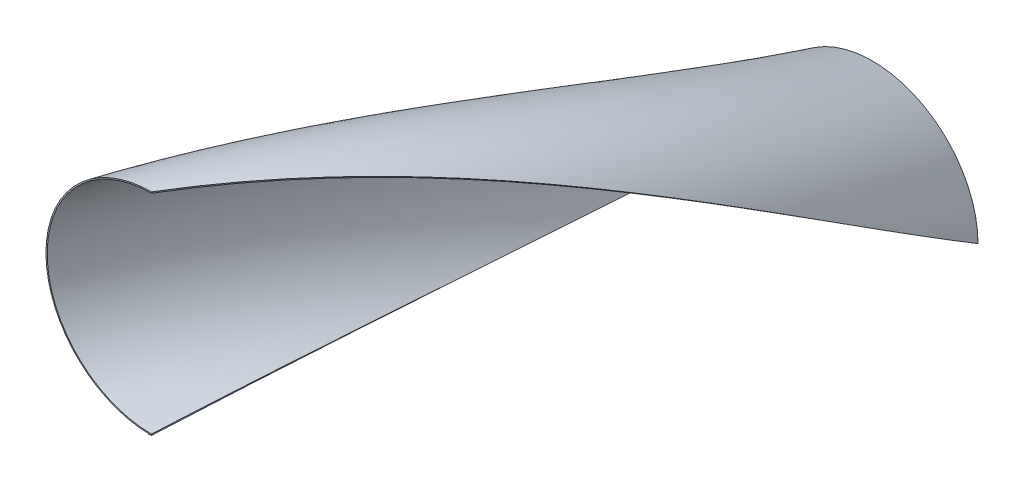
ISO-10303-21;
HEADER;
FILE_DESCRIPTION(('STEP AP214'),'2;1');
FILE_NAME('part.step','',(''),(''),'','','');
FILE_SCHEMA(('AUTOMOTIVE_DESIGN { 1 0 10303 214 1 1 1 1 }'));
ENDSEC;
DATA;
#1=APPLICATION_CONTEXT('core data for automotive mechanical design processes');
#2=APPLICATION_PROTOCOL_DEFINITION('international standard','automotive_design',2000,#1);
#3=PRODUCT_CONTEXT('',#1,'mechanical');
#4=PRODUCT('Part','Part','',(#3));
#5=PRODUCT_RELATED_PRODUCT_CATEGORY('part','',(#4));
#6=PRODUCT_DEFINITION_FORMATION('','',#4);
#7=PRODUCT_DEFINITION_CONTEXT('part definition',#1,'design');
#8=PRODUCT_DEFINITION('design','',#6,#7);
#9=PRODUCT_DEFINITION_SHAPE('','',#8);
#10=(LENGTH_UNIT() NAMED_UNIT(*) SI_UNIT(.MILLI.,.METRE.));
#11=(NAMED_UNIT(*) PLANE_ANGLE_UNIT() SI_UNIT($,.RADIAN.));
#12=(NAMED_UNIT(*) SI_UNIT($,.STERADIAN.) SOLID_ANGLE_UNIT());
#13=UNCERTAINTY_MEASURE_WITH_UNIT(LENGTH_MEASURE(1.E-05),#10,'distance_accuracy_value','');
#14=(GEOMETRIC_REPRESENTATION_CONTEXT(3) GLOBAL_UNCERTAINTY_ASSIGNED_CONTEXT((#13)) GLOBAL_UNIT_ASSIGNED_CONTEXT((#10,
#11,#12)) REPRESENTATION_CONTEXT('',''));
#15=CARTESIAN_POINT('',(0.,0.,0.));
#16=DIRECTION('',(0.,0.,1.));
#17=DIRECTION('',(1.,0.,0.));
#18=AXIS2_PLACEMENT_3D('',#15,#16,#17);
#19=CARTESIAN_POINT('',(30.0644669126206,4.74965929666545,0.1));
#20=CARTESIAN_POINT('',(29.9335434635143,5.57838057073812,17.490350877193));
#21=CARTESIAN_POINT('',(29.757166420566,6.39863116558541,34.880701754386));
#22=CARTESIAN_POINT('',(29.5807893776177,7.2188817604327,52.2710526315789));
#23=CARTESIAN_POINT('',(29.3594943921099,8.02817060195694,69.6614035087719));
#24=CARTESIAN_POINT('',(29.1381994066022,8.83745944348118,87.0517543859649));
#25=CARTESIAN_POINT('',(28.8726585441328,9.63332874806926,104.442105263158));
#26=CARTESIAN_POINT('',(28.6071176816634,10.4291980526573,121.832456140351));
#27=CARTESIAN_POINT('',(28.2981373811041,11.2092307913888,139.222807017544));
#28=CARTESIAN_POINT('',(27.9891570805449,11.9892635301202,156.613157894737));
#29=CARTESIAN_POINT('',(27.6376757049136,12.7510907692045,174.00350877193));
#30=CARTESIAN_POINT('',(27.2861943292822,13.5129180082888,191.393859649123));
#31=CARTESIAN_POINT('',(26.8932793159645,14.2542261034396,208.784210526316));
#32=CARTESIAN_POINT('',(26.5003643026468,14.9955341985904,226.174561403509));
#33=CARTESIAN_POINT('',(26.0672089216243,15.7140718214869,243.564912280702));
#34=CARTESIAN_POINT('',(25.6340535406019,16.4326094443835,260.955263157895));
#35=CARTESIAN_POINT('',(25.1619732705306,17.126194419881,278.345614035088));
#36=CARTESIAN_POINT('',(24.6898930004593,17.8197793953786,295.735964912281));
#37=CARTESIAN_POINT('',(24.1803215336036,18.4863053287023,313.126315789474));
#38=CARTESIAN_POINT('',(23.6707500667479,19.152831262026,330.516666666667));
#39=CARTESIAN_POINT('',(23.1252349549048,19.7902739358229,347.90701754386));
#40=CARTESIAN_POINT('',(22.5797198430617,20.4277166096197,365.297368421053));
#41=CARTESIAN_POINT('',(21.9999177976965,21.03414013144,382.687719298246));
#42=CARTESIAN_POINT('',(21.4201157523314,21.6405636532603,400.078070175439));
#43=CARTESIAN_POINT('',(20.8077876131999,22.2141263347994,417.468421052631));
#44=CARTESIAN_POINT('',(20.1954594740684,22.7876890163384,434.858771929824));
#45=CARTESIAN_POINT('',(19.5524648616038,23.3266489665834,452.249122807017));
#46=CARTESIAN_POINT('',(18.9094702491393,23.8656089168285,469.63947368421));
#47=CARTESIAN_POINT('',(18.2377619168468,24.3683293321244,487.029824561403));
#48=CARTESIAN_POINT('',(17.5660535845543,24.8710497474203,504.420175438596));
#49=CARTESIAN_POINT('',(16.8676714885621,25.3360038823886,521.810526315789));
#50=CARTESIAN_POINT('',(16.1692893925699,25.8009580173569,539.200877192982));
#51=CARTESIAN_POINT('',(15.4463544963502,26.2267338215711,556.591228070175));
#52=CARTESIAN_POINT('',(14.7234196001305,26.6525096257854,573.981578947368));
#53=CARTESIAN_POINT('',(13.9781274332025,27.037814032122,591.371929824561));
#54=CARTESIAN_POINT('',(13.2328352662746,27.4231184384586,608.762280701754));
#55=CARTESIAN_POINT('',(12.4674492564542,27.7667812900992,626.152631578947));
#56=CARTESIAN_POINT('',(11.7020632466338,28.1104441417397,643.54298245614));
#57=CARTESIAN_POINT('',(10.9189078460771,28.4114217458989,660.933333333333));
#58=CARTESIAN_POINT('',(10.1357524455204,28.7123993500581,678.323684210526));
#59=CARTESIAN_POINT('',(9.33720607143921,28.9697776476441,695.714035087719));
#60=CARTESIAN_POINT('',(8.538659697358,29.2271559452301,713.104385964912));
#61=CARTESIAN_POINT('',(7.72714750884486,29.4401532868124,730.494736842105));
#62=CARTESIAN_POINT('',(6.91563532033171,29.6531506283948,747.885087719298));
#63=CARTESIAN_POINT('',(6.09362185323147,29.8211201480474,765.275438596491));
#64=CARTESIAN_POINT('',(5.27160838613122,29.9890896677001,782.665789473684));
#65=CARTESIAN_POINT('',(4.44159006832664,30.1115212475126,800.056140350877));
#66=CARTESIAN_POINT('',(3.61157175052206,30.2339528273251,817.44649122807));
#67=CARTESIAN_POINT('',(2.77606932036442,30.3104746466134,834.836842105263));
#68=CARTESIAN_POINT('',(1.94056689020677,30.3869964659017,852.227192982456));
#69=CARTESIAN_POINT('',(1.10211774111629,30.4173761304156,869.617543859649));
#70=CARTESIAN_POINT('',(0.263668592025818,30.4477557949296,887.007894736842));
#71=CARTESIAN_POINT('',(-0.575180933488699,30.4319010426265,904.398245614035));
#72=CARTESIAN_POINT('',(-1.41403045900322,30.4160462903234,921.788596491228));
#73=CARTESIAN_POINT('',(-2.25073280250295,30.354005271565,939.178947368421));
#74=CARTESIAN_POINT('',(-3.08743514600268,30.2919642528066,956.569298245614));
#75=CARTESIAN_POINT('',(-3.91944926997,30.1839253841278,973.959649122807));
#76=CARTESIAN_POINT('',(-4.33537733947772,30.1299162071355,982.65317349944));
#77=CARTESIAN_POINT('',(-4.74965929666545,30.0644669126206,991.35));
#78=CARTESIAN_POINT('',(29.3849838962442,4.74965929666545,0.1));
#79=CARTESIAN_POINT('',(29.2540604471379,5.55965075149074,17.490350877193));
#80=CARTESIAN_POINT('',(29.0787151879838,6.36119996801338,34.880701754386));
#81=CARTESIAN_POINT('',(28.9033699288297,7.16274918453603,52.2710526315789));
#82=CARTESIAN_POINT('',(28.6841353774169,7.95342188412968,69.6614035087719));
#83=CARTESIAN_POINT('',(28.4649008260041,8.74409458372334,87.0517543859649));
#84=CARTESIAN_POINT('',(28.2024427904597,9.52148951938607,104.442105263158));
#85=CARTESIAN_POINT('',(27.9399847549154,10.2988844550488,121.832456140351));
#86=CARTESIAN_POINT('',(27.6351003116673,11.0606407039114,139.222807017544));
#87=CARTESIAN_POINT('',(27.3302158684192,11.822396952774,156.613157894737));
#88=CARTESIAN_POINT('',(26.9838309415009,12.5662010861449,174.00350877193));
#89=CARTESIAN_POINT('',(26.6374460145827,13.3100052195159,191.393859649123));
#90=CARTESIAN_POINT('',(26.2506125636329,14.0335983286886,208.784210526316));
#91=CARTESIAN_POINT('',(25.8637791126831,14.7571914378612,226.174561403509));
#92=CARTESIAN_POINT('',(25.4376719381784,15.4583759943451,243.564912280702));
#93=CARTESIAN_POINT('',(25.0115647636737,16.159560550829,260.955263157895));
#94=CARTESIAN_POINT('',(24.5474779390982,16.8362070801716,278.345614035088));
#95=CARTESIAN_POINT('',(24.0833911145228,17.5128536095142,295.735964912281));
#96=CARTESIAN_POINT('',(23.58273405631,18.162907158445,313.126315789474));
#97=CARTESIAN_POINT('',(23.0820769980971,18.8129607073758,330.516666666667));
#98=CARTESIAN_POINT('',(22.5463701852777,19.4344470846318,347.90701754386));
#99=CARTESIAN_POINT('',(22.0106633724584,20.0559334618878,365.297368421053));
#100=CARTESIAN_POINT('',(21.4415337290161,20.6469652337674,382.687719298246));
#101=CARTESIAN_POINT('',(20.8724040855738,21.237997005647,400.078070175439));
#102=CARTESIAN_POINT('',(20.2715800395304,21.7967792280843,417.468421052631));
#103=CARTESIAN_POINT('',(19.670755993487,22.3555614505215,434.858771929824));
#104=CARTESIAN_POINT('',(19.0400622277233,22.8803971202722,452.249122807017));
#105=CARTESIAN_POINT('',(18.4093684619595,23.4052327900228,469.63947368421));
#106=CARTESIAN_POINT('',(17.7507203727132,23.8945279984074,487.029824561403));
#107=CARTESIAN_POINT('',(17.092072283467,24.383823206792,504.420175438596));
#108=CARTESIAN_POINT('',(16.4074701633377,24.8360919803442,521.810526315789));
#109=CARTESIAN_POINT('',(15.7228680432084,25.2883607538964,539.200877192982));
#110=CARTESIAN_POINT('',(15.0143910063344,25.7022295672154,556.591228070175));
#111=CARTESIAN_POINT('',(14.3059139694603,26.1160983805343,573.981578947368));
#112=CARTESIAN_POINT('',(13.5757136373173,26.4903103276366,591.371929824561));
#113=CARTESIAN_POINT('',(12.8455133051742,26.8645222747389,608.762280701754));
#114=CARTESIAN_POINT('',(12.0958072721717,27.1979408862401,626.152631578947));
#115=CARTESIAN_POINT('',(11.3461012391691,27.5313594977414,643.54298245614));
#116=CARTESIAN_POINT('',(10.5791663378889,27.8229721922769,660.933333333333));
#117=CARTESIAN_POINT('',(9.81223143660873,28.1145848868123,678.323684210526));
#118=CARTESIAN_POINT('',(9.03039682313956,28.3635060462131,695.714035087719));
#119=CARTESIAN_POINT('',(8.24856220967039,28.6124272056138,713.104385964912));
#120=CARTESIAN_POINT('',(7.45420229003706,28.8179008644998,730.494736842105));
#121=CARTESIAN_POINT('',(6.65984237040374,29.0233745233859,747.885087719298));
#122=CARTESIAN_POINT('',(5.85536958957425,29.1847766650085,765.275438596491));
#123=CARTESIAN_POINT('',(5.05089680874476,29.3461788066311,782.665789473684));
#124=CARTESIAN_POINT('',(4.23875432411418,29.4630192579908,800.056140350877));
#125=CARTESIAN_POINT('',(3.4266118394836,29.5798597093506,817.44649122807));
#126=CARTESIAN_POINT('',(2.60926610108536,29.6517836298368,834.836842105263));
#127=CARTESIAN_POINT('',(1.79192036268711,29.7237075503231,852.227192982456));
#128=CARTESIAN_POINT('',(0.971853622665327,29.7504965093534,869.617543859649));
#129=CARTESIAN_POINT('',(0.15178688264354,29.7772854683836,887.007894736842));
#130=CARTESIAN_POINT('',(-0.668510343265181,29.7588581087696,904.398245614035));
#131=CARTESIAN_POINT('',(-1.4888075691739,29.7404307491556,921.788596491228));
#132=CARTESIAN_POINT('',(-2.30684406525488,29.6768430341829,939.178947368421));
#133=CARTESIAN_POINT('',(-3.12488056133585,29.6132553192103,956.569298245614));
#134=CARTESIAN_POINT('',(-3.93817197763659,29.5047003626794,973.959649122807));
#135=CARTESIAN_POINT('',(-4.34474047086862,29.4504331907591,982.65317349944));
#136=CARTESIAN_POINT('',(-4.74965929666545,29.3849838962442,991.35));
#137=(BOUNDED_SURFACE() B_SPLINE_SURFACE(1,2,((#19,#20,#21,#22,#23,#24,#25,#26,#27,#28,#29,#30,
#31,#32,#33,#34,#35,#36,#37,#38,#39,#40,#41,#42,#43,#44,#45,#46,#47,#48,#49,#50,#51,#52,#53,#54,
#55,#56,#57,#58,#59,#60,#61,#62,#63,#64,#65,#66,#67,#68,#69,#70,#71,#72,#73,#74,#75,#76,#77),
(#78,#79,#80,#81,#82,#83,#84,#85,#86,#87,#88,#89,#90,#91,#92,#93,#94,#95,#96,#97,#98,#99,#100,
#101,#102,#103,#104,#105,#106,#107,#108,#109,#110,#111,#112,#113,#114,#115,#116,#117,#118,#119,
#120,#121,#122,#123,#124,#125,#126,#127,#128,#129,#130,#131,#132,#133,#134,#135,#136)),
.UNSPECIFIED.,.F.,.F.,.F.) B_SPLINE_SURFACE_WITH_KNOTS((2,2),(3,2,2,2,2,2,2,2,2,2,2,2,2,2,2,2,2,
2,2,2,2,2,2,2,2,2,2,2,2,3),(0.,1.),(0.,0.0087719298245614,0.0175438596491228,0.0263157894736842,
0.0350877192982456,0.043859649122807,0.0526315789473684,0.0614035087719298,0.0701754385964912,
0.0789473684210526,0.087719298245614,0.0964912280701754,0.105263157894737,0.114035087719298,
0.12280701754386,0.131578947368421,0.140350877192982,0.149122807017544,0.157894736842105,
0.166666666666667,0.175438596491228,0.184210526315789,0.192982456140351,0.201754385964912,
0.210526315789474,0.219298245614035,0.228070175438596,0.236842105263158,0.245614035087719,0.25),
.UNSPECIFIED.) GEOMETRIC_REPRESENTATION_ITEM() RATIONAL_B_SPLINE_SURFACE(((1.,0.999620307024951,
1.,0.999620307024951,1.,0.999620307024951,1.,0.999620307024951,1.,0.999620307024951,1.,
0.999620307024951,1.,0.999620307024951,1.,0.999620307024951,1.,0.999620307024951,1.,
0.999620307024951,1.,0.999620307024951,1.,0.999620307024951,1.,0.999620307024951,1.,
0.999620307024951,1.,0.999620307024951,1.,0.999620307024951,1.,0.999620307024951,1.,
0.999620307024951,1.,0.999620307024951,1.,0.999620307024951,1.,0.999620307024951,1.,
0.999620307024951,1.,0.999620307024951,1.,0.999620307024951,1.,0.999620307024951,1.,
0.999620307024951,1.,0.999620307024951,1.,0.999620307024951,1.,0.999810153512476,
0.999810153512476),(1.,0.999620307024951,1.,0.999620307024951,1.,0.999620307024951,1.,
0.999620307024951,1.,0.999620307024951,1.,0.999620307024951,1.,0.999620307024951,1.,
0.999620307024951,1.,0.999620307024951,1.,0.999620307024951,1.,0.999620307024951,1.,
0.999620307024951,1.,0.999620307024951,1.,0.999620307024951,1.,0.999620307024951,1.,
0.999620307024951,1.,0.999620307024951,1.,0.999620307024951,1.,0.999620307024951,1.,
0.999620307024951,1.,0.999620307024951,1.,0.999620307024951,1.,0.999620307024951,1.,
0.999620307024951,1.,0.999620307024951,1.,0.999620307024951,1.,0.999620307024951,1.,
0.999620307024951,1.,0.999810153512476,0.999810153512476))) REPRESENTATION_ITEM('') SURFACE());
#138=CARTESIAN_POINT('',(29.6216261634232,4.74965929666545,0.1));
#139=CARTESIAN_POINT('',(29.4907027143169,5.56617375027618,17.490350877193));
#140=CARTESIAN_POINT('',(29.3149981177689,6.37423606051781,34.880701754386));
#141=CARTESIAN_POINT('',(29.1392935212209,7.18229837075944,52.2710526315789));
#142=CARTESIAN_POINT('',(28.9193413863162,7.97945447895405,69.6614035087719));
#143=CARTESIAN_POINT('',(28.6993892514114,8.77661058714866,87.0517543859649));
#144=CARTESIAN_POINT('',(28.4358575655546,9.5604395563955,104.442105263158));
#145=CARTESIAN_POINT('',(28.1723258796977,10.3442685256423,121.832456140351));
#146=CARTESIAN_POINT('',(27.8660149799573,11.1123898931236,139.222807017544));
#147=CARTESIAN_POINT('',(27.5597040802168,11.8805112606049,156.613157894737));
#148=CARTESIAN_POINT('',(27.2115442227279,12.6305922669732,174.00350877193));
#149=CARTESIAN_POINT('',(26.863384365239,13.3806732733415,191.393859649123));
#150=CARTESIAN_POINT('',(26.4744329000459,14.110435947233,208.784210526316));
#151=CARTESIAN_POINT('',(26.0854814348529,14.8401986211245,226.174561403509));
#152=CARTESIAN_POINT('',(25.656919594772,15.5474266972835,243.564912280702));
#153=CARTESIAN_POINT('',(25.2283577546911,16.2546547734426,260.955263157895));
#154=CARTESIAN_POINT('',(24.7614870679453,16.937200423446,278.345614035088));
#155=CARTESIAN_POINT('',(24.2946163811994,17.6197460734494,295.735964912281));
#156=CARTESIAN_POINT('',(23.7908547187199,18.2755364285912,313.126315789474));
#157=CARTESIAN_POINT('',(23.2870930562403,18.931326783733,330.516666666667));
#158=CARTESIAN_POINT('',(22.747970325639,19.5583702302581,347.90701754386));
#159=CARTESIAN_POINT('',(22.2088475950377,20.1854136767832,365.297368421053));
#160=CARTESIAN_POINT('',(21.6360010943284,20.7818059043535,382.687719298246));
#161=CARTESIAN_POINT('',(21.063154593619,21.3781981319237,400.078070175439));
#162=CARTESIAN_POINT('',(20.4583240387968,21.9421279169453,417.468421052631));
#163=CARTESIAN_POINT('',(19.8534934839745,22.5060577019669,434.858771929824));
#164=CARTESIAN_POINT('',(19.2185157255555,23.0358124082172,452.249122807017));
#165=CARTESIAN_POINT('',(18.5835379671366,23.5655671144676,469.63947368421));
#166=CARTESIAN_POINT('',(17.9203414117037,24.059537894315,487.029824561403));
#167=CARTESIAN_POINT('',(17.2571448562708,24.5535086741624,504.420175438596));
#168=CARTESIAN_POINT('',(16.5677436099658,25.0101953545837,521.810526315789));
#169=CARTESIAN_POINT('',(15.8783423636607,25.466882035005,539.200877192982));
#170=CARTESIAN_POINT('',(15.1648301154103,25.8848976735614,556.591228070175));
#171=CARTESIAN_POINT('',(14.4513178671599,26.3029133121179,573.981578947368));
#172=CARTESIAN_POINT('',(13.7158615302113,26.6809884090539,591.371929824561));
#173=CARTESIAN_POINT('',(12.9804051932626,27.05906350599,608.762280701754));
#174=CARTESIAN_POINT('',(12.2252383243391,27.3960498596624,626.152631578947));
#175=CARTESIAN_POINT('',(11.4700714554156,27.7330362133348,643.54298245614));
#176=CARTESIAN_POINT('',(10.6974874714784,28.027910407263,660.933333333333));
#177=CARTESIAN_POINT('',(9.92490348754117,28.3227846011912,678.323684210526));
#178=CARTESIAN_POINT('',(9.13724870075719,28.5746511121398,695.714035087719));
#179=CARTESIAN_POINT('',(8.34959391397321,28.8265176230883,713.104385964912));
#180=CARTESIAN_POINT('',(7.54926040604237,29.0346115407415,730.494736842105));
#181=CARTESIAN_POINT('',(6.74892689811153,29.2427054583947,747.885087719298));
#182=CARTESIAN_POINT('',(5.93834525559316,29.4063948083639,765.275438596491));
#183=CARTESIAN_POINT('',(5.12776361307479,29.5700841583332,782.665789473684));
#184=CARTESIAN_POINT('',(4.30939554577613,29.6888718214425,800.056140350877));
#185=CARTESIAN_POINT('',(3.49102747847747,29.8076594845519,817.44649122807));
#186=CARTESIAN_POINT('',(2.66735834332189,29.8811847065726,834.836842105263));
#187=CARTESIAN_POINT('',(1.84368920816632,29.9547099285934,852.227192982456));
#188=CARTESIAN_POINT('',(1.01722046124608,29.9827494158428,869.617543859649));
#189=CARTESIAN_POINT('',(0.190751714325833,30.0107889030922,887.007894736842));
#190=CARTESIAN_POINT('',(-0.636006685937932,29.9932575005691,904.398245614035));
#191=CARTESIAN_POINT('',(-1.4627650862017,29.9757260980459,921.788596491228));
#192=CARTESIAN_POINT('',(-2.28730230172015,29.9126770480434,939.178947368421));
#193=CARTESIAN_POINT('',(-3.1118395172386,29.849627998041,956.569298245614));
#194=CARTESIAN_POINT('',(-3.93165145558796,29.7412527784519,973.959649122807));
#195=CARTESIAN_POINT('',(-4.34147959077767,29.6870754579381,982.65317349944));
#196=CARTESIAN_POINT('',(-4.74965929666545,29.6216261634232,991.35));
#197=(BOUNDED_CURVE() B_SPLINE_CURVE(2,(#138,#139,#140,#141,#142,#143,#144,#145,#146,#147,#148,
#149,#150,#151,#152,#153,#154,#155,#156,#157,#158,#159,#160,#161,#162,#163,#164,#165,#166,#167,
#168,#169,#170,#171,#172,#173,#174,#175,#176,#177,#178,#179,#180,#181,#182,#183,#184,#185,#186,
#187,#188,#189,#190,#191,#192,#193,#194,#195,#196),.UNSPECIFIED.,.F.,
.F.) B_SPLINE_CURVE_WITH_KNOTS((3,2,2,2,2,2,2,2,2,2,2,2,2,2,2,2,2,2,2,2,2,2,2,2,2,2,2,2,2,3),
(0.,0.0087719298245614,0.0175438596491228,0.0263157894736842,0.0350877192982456,
0.043859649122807,0.0526315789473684,0.0614035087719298,0.0701754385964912,0.0789473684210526,
0.087719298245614,0.0964912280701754,0.105263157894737,0.114035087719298,0.12280701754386,
0.131578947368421,0.140350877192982,0.149122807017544,0.157894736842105,0.166666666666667,
0.175438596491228,0.184210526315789,0.192982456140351,0.201754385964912,0.210526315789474,
0.219298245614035,0.228070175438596,0.236842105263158,0.245614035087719,0.25),
.UNSPECIFIED.) CURVE() GEOMETRIC_REPRESENTATION_ITEM() RATIONAL_B_SPLINE_CURVE((1.,
0.999620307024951,1.,0.999620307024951,1.,0.999620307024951,1.,0.999620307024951,1.,
0.999620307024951,1.,0.999620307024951,1.,0.999620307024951,1.,0.999620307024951,1.,
0.999620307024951,1.,0.999620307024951,1.,0.999620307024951,1.,0.999620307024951,1.,
0.999620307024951,1.,0.999620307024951,1.,0.999620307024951,1.,0.999620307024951,1.,
0.999620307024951,1.,0.999620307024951,1.,0.999620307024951,1.,0.999620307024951,1.,
0.999620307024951,1.,0.999620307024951,1.,0.999620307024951,1.,0.999620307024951,1.,
0.999620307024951,1.,0.999620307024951,1.,0.999620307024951,1.,0.999620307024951,1.,
0.999810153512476,0.999810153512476)) REPRESENTATION_ITEM(''));
#198=CARTESIAN_POINT('',(29.6148204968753,4.79191057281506,1.));
#199=VERTEX_POINT('',#198);
#200=CARTESIAN_POINT('',(29.6216261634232,4.74965929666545,0.1));
#201=VERTEX_POINT('',#200);
#202=EDGE_CURVE('E68',#199,#201,#197,.F.);
#203=CARTESIAN_POINT('',(30.0576607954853,4.79254229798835,1.));
#204=CARTESIAN_POINT('',(30.0293382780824,4.79250189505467,1.));
#205=CARTESIAN_POINT('',(30.0010157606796,4.79246149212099,1.));
#206=CARTESIAN_POINT('',(29.9443707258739,4.79238068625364,1.));
#207=CARTESIAN_POINT('',(29.916048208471,4.79234028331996,1.));
#208=CARTESIAN_POINT('',(29.8594031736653,4.79225947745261,1.));
#209=CARTESIAN_POINT('',(29.8310806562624,4.79221907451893,1.));
#210=CARTESIAN_POINT('',(29.7744356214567,4.79213826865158,1.));
#211=CARTESIAN_POINT('',(29.7461131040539,4.7920978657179,1.));
#212=CARTESIAN_POINT('',(29.6894680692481,4.79201705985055,1.));
#213=CARTESIAN_POINT('',(29.6611455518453,4.79197665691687,1.));
#214=CARTESIAN_POINT('',(29.6045005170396,4.79189585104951,1.));
#215=CARTESIAN_POINT('',(29.5761779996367,4.79185544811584,1.));
#216=CARTESIAN_POINT('',(29.4912964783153,4.79173436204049,1.));
#217=CARTESIAN_POINT('',(29.4347374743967,4.79165367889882,1.));
#218=CARTESIAN_POINT('',(29.3781784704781,4.79157299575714,1.));
#219=B_SPLINE_CURVE_WITH_KNOTS('',3,(#203,#204,#205,#206,#207,#208,#209,#210,#211,#212,#213,
#214,#215,#216,#217,#218),.UNSPECIFIED.,.F.,.F.,(4,2,2,2,2,2,2,4),(0.,0.0849676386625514,
0.169935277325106,0.254902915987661,0.339870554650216,0.424838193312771,0.509805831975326,
0.679483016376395),.UNSPECIFIED.);
#220=CARTESIAN_POINT('',(29.3781784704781,4.79157299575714,1.));
#221=VERTEX_POINT('',#220);
#222=EDGE_CURVE('E141',#199,#221,#219,.T.);
#223=CARTESIAN_POINT('',(29.3849838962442,4.74965929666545,0.1));
#224=CARTESIAN_POINT('',(29.2540604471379,5.55965075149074,17.490350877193));
#225=CARTESIAN_POINT('',(29.0787151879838,6.36119996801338,34.880701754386));
#226=CARTESIAN_POINT('',(28.9033699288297,7.16274918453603,52.2710526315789));
#227=CARTESIAN_POINT('',(28.6841353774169,7.95342188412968,69.6614035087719));
#228=CARTESIAN_POINT('',(28.4649008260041,8.74409458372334,87.0517543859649));
#229=CARTESIAN_POINT('',(28.2024427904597,9.52148951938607,104.442105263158));
#230=CARTESIAN_POINT('',(27.9399847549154,10.2988844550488,121.832456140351));
#231=CARTESIAN_POINT('',(27.6351003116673,11.0606407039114,139.222807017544));
#232=CARTESIAN_POINT('',(27.3302158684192,11.822396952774,156.613157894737));
#233=CARTESIAN_POINT('',(26.9838309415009,12.5662010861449,174.00350877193));
#234=CARTESIAN_POINT('',(26.6374460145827,13.3100052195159,191.393859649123));
#235=CARTESIAN_POINT('',(26.2506125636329,14.0335983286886,208.784210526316));
#236=CARTESIAN_POINT('',(25.8637791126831,14.7571914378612,226.174561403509));
#237=CARTESIAN_POINT('',(25.4376719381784,15.4583759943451,243.564912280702));
#238=CARTESIAN_POINT('',(25.0115647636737,16.159560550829,260.955263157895));
#239=CARTESIAN_POINT('',(24.5474779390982,16.8362070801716,278.345614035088));
#240=CARTESIAN_POINT('',(24.0833911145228,17.5128536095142,295.735964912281));
#241=CARTESIAN_POINT('',(23.58273405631,18.162907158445,313.126315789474));
#242=CARTESIAN_POINT('',(23.0820769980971,18.8129607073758,330.516666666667));
#243=CARTESIAN_POINT('',(22.5463701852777,19.4344470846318,347.90701754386));
#244=CARTESIAN_POINT('',(22.0106633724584,20.0559334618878,365.297368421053));
#245=CARTESIAN_POINT('',(21.4415337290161,20.6469652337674,382.687719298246));
#246=CARTESIAN_POINT('',(20.8724040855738,21.237997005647,400.078070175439));
#247=CARTESIAN_POINT('',(20.2715800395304,21.7967792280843,417.468421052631));
#248=CARTESIAN_POINT('',(19.670755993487,22.3555614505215,434.858771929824));
#249=CARTESIAN_POINT('',(19.0400622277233,22.8803971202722,452.249122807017));
#250=CARTESIAN_POINT('',(18.4093684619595,23.4052327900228,469.63947368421));
#251=CARTESIAN_POINT('',(17.7507203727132,23.8945279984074,487.029824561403));
#252=CARTESIAN_POINT('',(17.092072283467,24.383823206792,504.420175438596));
#253=CARTESIAN_POINT('',(16.4074701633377,24.8360919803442,521.810526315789));
#254=CARTESIAN_POINT('',(15.7228680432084,25.2883607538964,539.200877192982));
#255=CARTESIAN_POINT('',(15.0143910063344,25.7022295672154,556.591228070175));
#256=CARTESIAN_POINT('',(14.3059139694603,26.1160983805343,573.981578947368));
#257=CARTESIAN_POINT('',(13.5757136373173,26.4903103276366,591.371929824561));
#258=CARTESIAN_POINT('',(12.8455133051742,26.8645222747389,608.762280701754));
#259=CARTESIAN_POINT('',(12.0958072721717,27.1979408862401,626.152631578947));
#260=CARTESIAN_POINT('',(11.3461012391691,27.5313594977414,643.54298245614));
#261=CARTESIAN_POINT('',(10.5791663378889,27.8229721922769,660.933333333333));
#262=CARTESIAN_POINT('',(9.81223143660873,28.1145848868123,678.323684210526));
#263=CARTESIAN_POINT('',(9.03039682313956,28.3635060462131,695.714035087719));
#264=CARTESIAN_POINT('',(8.24856220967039,28.6124272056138,713.104385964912));
#265=CARTESIAN_POINT('',(7.45420229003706,28.8179008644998,730.494736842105));
#266=CARTESIAN_POINT('',(6.65984237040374,29.0233745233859,747.885087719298));
#267=CARTESIAN_POINT('',(5.85536958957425,29.1847766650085,765.275438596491));
#268=CARTESIAN_POINT('',(5.05089680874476,29.3461788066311,782.665789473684));
#269=CARTESIAN_POINT('',(4.23875432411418,29.4630192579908,800.056140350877));
#270=CARTESIAN_POINT('',(3.4266118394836,29.5798597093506,817.44649122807));
#271=CARTESIAN_POINT('',(2.60926610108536,29.6517836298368,834.836842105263));
#272=CARTESIAN_POINT('',(1.79192036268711,29.7237075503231,852.227192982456));
#273=CARTESIAN_POINT('',(0.971853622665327,29.7504965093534,869.617543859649));
#274=CARTESIAN_POINT('',(0.15178688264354,29.7772854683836,887.007894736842));
#275=CARTESIAN_POINT('',(-0.668510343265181,29.7588581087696,904.398245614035));
#276=CARTESIAN_POINT('',(-1.4888075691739,29.7404307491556,921.788596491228));
#277=CARTESIAN_POINT('',(-2.30684406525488,29.6768430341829,939.178947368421));
#278=CARTESIAN_POINT('',(-3.12488056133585,29.6132553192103,956.569298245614));
#279=CARTESIAN_POINT('',(-3.93817197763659,29.5047003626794,973.959649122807));
#280=CARTESIAN_POINT('',(-4.34474047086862,29.4504331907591,982.65317349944));
#281=CARTESIAN_POINT('',(-4.74965929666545,29.3849838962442,991.35));
#282=(BOUNDED_CURVE() B_SPLINE_CURVE(2,(#223,#224,#225,#226,#227,#228,#229,#230,#231,#232,#233,
#234,#235,#236,#237,#238,#239,#240,#241,#242,#243,#244,#245,#246,#247,#248,#249,#250,#251,#252,
#253,#254,#255,#256,#257,#258,#259,#260,#261,#262,#263,#264,#265,#266,#267,#268,#269,#270,#271,
#272,#273,#274,#275,#276,#277,#278,#279,#280,#281),.UNSPECIFIED.,.F.,
.F.) B_SPLINE_CURVE_WITH_KNOTS((3,2,2,2,2,2,2,2,2,2,2,2,2,2,2,2,2,2,2,2,2,2,2,2,2,2,2,2,2,3),
(0.,0.0087719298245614,0.0175438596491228,0.0263157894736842,0.0350877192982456,
0.043859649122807,0.0526315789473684,0.0614035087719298,0.0701754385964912,0.0789473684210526,
0.087719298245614,0.0964912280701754,0.105263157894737,0.114035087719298,0.12280701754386,
0.131578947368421,0.140350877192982,0.149122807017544,0.157894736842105,0.166666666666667,
0.175438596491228,0.184210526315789,0.192982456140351,0.201754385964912,0.210526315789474,
0.219298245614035,0.228070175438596,0.236842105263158,0.245614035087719,0.25),
.UNSPECIFIED.) CURVE() GEOMETRIC_REPRESENTATION_ITEM() RATIONAL_B_SPLINE_CURVE((1.,
0.999620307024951,1.,0.999620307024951,1.,0.999620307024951,1.,0.999620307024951,1.,
0.999620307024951,1.,0.999620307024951,1.,0.999620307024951,1.,0.999620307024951,1.,
0.999620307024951,1.,0.999620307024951,1.,0.999620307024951,1.,0.999620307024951,1.,
0.999620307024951,1.,0.999620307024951,1.,0.999620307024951,1.,0.999620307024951,1.,
0.999620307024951,1.,0.999620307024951,1.,0.999620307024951,1.,0.999620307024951,1.,
0.999620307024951,1.,0.999620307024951,1.,0.999620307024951,1.,0.999620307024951,1.,
0.999620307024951,1.,0.999620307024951,1.,0.999620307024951,1.,0.999620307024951,1.,
0.999810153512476,0.999810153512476)) REPRESENTATION_ITEM(''));
#283=CARTESIAN_POINT('',(-4.74965929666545,29.3849838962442,991.35));
#284=VERTEX_POINT('',#283);
#285=EDGE_CURVE('E149',#221,#284,#282,.T.);
#286=CARTESIAN_POINT('',(-4.74965929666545,29.3849838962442,991.35));
#287=CARTESIAN_POINT('',(-4.74965929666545,30.0644669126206,991.35));
#288=(BOUNDED_CURVE() B_SPLINE_CURVE(1,(#286,#287),.UNSPECIFIED.,.F.,
.F.) B_SPLINE_CURVE_WITH_KNOTS((2,2),(0.,1.),
.UNSPECIFIED.) CURVE() GEOMETRIC_REPRESENTATION_ITEM() RATIONAL_B_SPLINE_CURVE((0.999810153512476,0.999810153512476)) REPRESENTATION_ITEM(''));
#289=CARTESIAN_POINT('',(-4.74965929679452,30.0644669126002,991.350000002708));
#290=VERTEX_POINT('',#289);
#291=EDGE_CURVE('E284',#284,#290,#288,.T.);
#292=CARTESIAN_POINT('',(30.0644669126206,4.7496592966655,0.1));
#293=CARTESIAN_POINT('',(29.9335434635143,5.57838057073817,17.490350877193));
#294=CARTESIAN_POINT('',(29.757166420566,6.39863116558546,34.880701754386));
#295=CARTESIAN_POINT('',(29.5807893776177,7.21888176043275,52.2710526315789));
#296=CARTESIAN_POINT('',(29.3594943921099,8.028170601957,69.6614035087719));
#297=CARTESIAN_POINT('',(29.1381994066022,8.83745944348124,87.0517543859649));
#298=CARTESIAN_POINT('',(28.8726585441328,9.63332874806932,104.442105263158));
#299=CARTESIAN_POINT('',(28.6071176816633,10.4291980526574,121.832456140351));
#300=CARTESIAN_POINT('',(28.2981373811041,11.2092307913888,139.222807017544));
#301=CARTESIAN_POINT('',(27.9891570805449,11.9892635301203,156.613157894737));
#302=CARTESIAN_POINT('',(27.6376757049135,12.7510907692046,174.00350877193));
#303=CARTESIAN_POINT('',(27.2861943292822,13.5129180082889,191.393859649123));
#304=CARTESIAN_POINT('',(26.8932793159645,14.2542261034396,208.784210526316));
#305=CARTESIAN_POINT('',(26.5003643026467,14.9955341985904,226.174561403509));
#306=CARTESIAN_POINT('',(26.0672089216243,15.714071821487,243.564912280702));
#307=CARTESIAN_POINT('',(25.6340535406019,16.4326094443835,260.955263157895));
#308=CARTESIAN_POINT('',(25.1619732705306,17.1261944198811,278.345614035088));
#309=CARTESIAN_POINT('',(24.6898930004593,17.8197793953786,295.735964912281));
#310=CARTESIAN_POINT('',(24.1803215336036,18.4863053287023,313.126315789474));
#311=CARTESIAN_POINT('',(23.6707500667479,19.1528312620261,330.516666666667));
#312=CARTESIAN_POINT('',(23.1252349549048,19.7902739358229,347.90701754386));
#313=CARTESIAN_POINT('',(22.5797198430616,20.4277166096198,365.297368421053));
#314=CARTESIAN_POINT('',(21.9999177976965,21.0341401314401,382.687719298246));
#315=CARTESIAN_POINT('',(21.4201157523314,21.6405636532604,400.078070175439));
#316=CARTESIAN_POINT('',(20.8077876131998,22.2141263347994,417.468421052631));
#317=CARTESIAN_POINT('',(20.1954594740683,22.7876890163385,434.858771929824));
#318=CARTESIAN_POINT('',(19.5524648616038,23.3266489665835,452.249122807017));
#319=CARTESIAN_POINT('',(18.9094702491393,23.8656089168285,469.63947368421));
#320=CARTESIAN_POINT('',(18.2377619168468,24.3683293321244,487.029824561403));
#321=CARTESIAN_POINT('',(17.5660535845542,24.8710497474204,504.420175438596));
#322=CARTESIAN_POINT('',(16.8676714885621,25.3360038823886,521.810526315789));
#323=CARTESIAN_POINT('',(16.1692893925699,25.8009580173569,539.200877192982));
#324=CARTESIAN_POINT('',(15.4463544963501,26.2267338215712,556.591228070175));
#325=CARTESIAN_POINT('',(14.7234196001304,26.6525096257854,573.981578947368));
#326=CARTESIAN_POINT('',(13.9781274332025,27.037814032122,591.371929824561));
#327=CARTESIAN_POINT('',(13.2328352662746,27.4231184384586,608.762280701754));
#328=CARTESIAN_POINT('',(12.4674492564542,27.7667812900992,626.152631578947));
#329=CARTESIAN_POINT('',(11.7020632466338,28.1104441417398,643.54298245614));
#330=CARTESIAN_POINT('',(10.9189078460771,28.4114217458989,660.933333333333));
#331=CARTESIAN_POINT('',(10.1357524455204,28.7123993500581,678.323684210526));
#332=CARTESIAN_POINT('',(9.33720607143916,28.9697776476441,695.714035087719));
#333=CARTESIAN_POINT('',(8.53865969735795,29.2271559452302,713.104385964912));
#334=CARTESIAN_POINT('',(7.72714750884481,29.4401532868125,730.494736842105));
#335=CARTESIAN_POINT('',(6.91563532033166,29.6531506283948,747.885087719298));
#336=CARTESIAN_POINT('',(6.09362185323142,29.8211201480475,765.275438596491));
#337=CARTESIAN_POINT('',(5.27160838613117,29.9890896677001,782.665789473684));
#338=CARTESIAN_POINT('',(4.44159006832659,30.1115212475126,800.056140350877));
#339=CARTESIAN_POINT('',(3.61157175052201,30.2339528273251,817.44649122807));
#340=CARTESIAN_POINT('',(2.77606932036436,30.3104746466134,834.836842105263));
#341=CARTESIAN_POINT('',(1.94056689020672,30.3869964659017,852.227192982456));
#342=CARTESIAN_POINT('',(1.10211774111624,30.4173761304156,869.617543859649));
#343=CARTESIAN_POINT('',(0.263668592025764,30.4477557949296,887.007894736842));
#344=CARTESIAN_POINT('',(-0.575180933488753,30.4319010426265,904.398245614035));
#345=CARTESIAN_POINT('',(-1.41403045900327,30.4160462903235,921.788596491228));
#346=CARTESIAN_POINT('',(-2.250732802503,30.354005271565,939.178947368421));
#347=CARTESIAN_POINT('',(-3.08743514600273,30.2919642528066,956.569298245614));
#348=CARTESIAN_POINT('',(-3.91944926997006,30.1839253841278,973.959649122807));
#349=CARTESIAN_POINT('',(-4.33537733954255,30.1299162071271,982.653173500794));
#350=CARTESIAN_POINT('',(-4.74965929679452,30.0644669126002,991.350000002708));
#351=(BOUNDED_CURVE() B_SPLINE_CURVE(2,(#292,#293,#294,#295,#296,#297,#298,#299,#300,#301,#302,
#303,#304,#305,#306,#307,#308,#309,#310,#311,#312,#313,#314,#315,#316,#317,#318,#319,#320,#321,
#322,#323,#324,#325,#326,#327,#328,#329,#330,#331,#332,#333,#334,#335,#336,#337,#338,#339,#340,
#341,#342,#343,#344,#345,#346,#347,#348,#349,#350),.UNSPECIFIED.,.F.,
.F.) B_SPLINE_CURVE_WITH_KNOTS((3,2,2,2,2,2,2,2,2,2,2,2,2,2,2,2,2,2,2,2,2,2,2,2,2,2,2,2,2,3),
(0.,0.0087719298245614,0.0175438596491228,0.0263157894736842,0.0350877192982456,
0.043859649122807,0.0526315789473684,0.0614035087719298,0.0701754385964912,0.0789473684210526,
0.087719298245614,0.0964912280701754,0.105263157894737,0.114035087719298,0.12280701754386,
0.131578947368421,0.140350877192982,0.149122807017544,0.157894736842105,0.166666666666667,
0.175438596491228,0.184210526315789,0.192982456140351,0.201754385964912,0.210526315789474,
0.219298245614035,0.228070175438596,0.236842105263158,0.245614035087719,0.250000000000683),
.UNSPECIFIED.) CURVE() GEOMETRIC_REPRESENTATION_ITEM() RATIONAL_B_SPLINE_CURVE((1.,
0.999620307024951,1.,0.999620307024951,1.,0.999620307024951,1.,0.999620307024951,1.,
0.999620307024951,1.,0.999620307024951,1.,0.999620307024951,1.,0.999620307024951,1.,
0.999620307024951,1.,0.999620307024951,1.,0.999620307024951,1.,0.999620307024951,1.,
0.999620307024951,1.,0.999620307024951,1.,0.999620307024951,1.,0.999620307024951,1.,
0.999620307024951,1.,0.999620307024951,1.,0.999620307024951,1.,0.999620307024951,1.,
0.999620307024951,1.,0.999620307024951,1.,0.999620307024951,1.,0.999620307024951,1.,
0.999620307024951,1.,0.999620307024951,1.,0.999620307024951,1.,0.999620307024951,1.,
0.999810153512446,0.999810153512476)) REPRESENTATION_ITEM(''));
#352=CARTESIAN_POINT('',(30.0644669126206,4.7496592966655,0.1));
#353=VERTEX_POINT('',#352);
#354=EDGE_CURVE('E156',#353,#290,#351,.T.);
#355=DIRECTION('',(-1.,0.,0.));
#356=VECTOR('',#355,1.);
#357=CARTESIAN_POINT('',(29.7247254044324,4.74965929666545,0.1));
#358=LINE('',#357,#356);
#359=EDGE_CURVE('E280',#353,#201,#358,.T.);
#360=ORIENTED_EDGE('',*,*,#202,.F.);
#361=ORIENTED_EDGE('',*,*,#222,.T.);
#362=ORIENTED_EDGE('',*,*,#285,.T.);
#363=ORIENTED_EDGE('',*,*,#291,.T.);
#364=ORIENTED_EDGE('',*,*,#354,.F.);
#365=ORIENTED_EDGE('',*,*,#359,.T.);
#366=EDGE_LOOP('',(#360,#361,#362,#363,#364,#365));
#367=FACE_BOUND('',#366,.T.);
#368=ADVANCED_FACE('F54',(#367),#137,.T.);
#369=CARTESIAN_POINT('',(-108.382461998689,67.6018852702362,991.350000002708));
#370=DIRECTION('',(0.,0.,1.));
#371=DIRECTION('',(1.,0.,0.));
#372=AXIS2_PLACEMENT_3D('',#369,#370,#371);
#373=PLANE('',#372);
#374=CARTESIAN_POINT('',(-4.74965929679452,30.0644669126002,991.350000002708));
#375=CARTESIAN_POINT('',(-345.343620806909,39.3119036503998,991.350000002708));
#376=CARTESIAN_POINT('',(-340.719476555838,379.999999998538,991.350000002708));
#377=CARTESIAN_POINT('',(-1.63065647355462E-09,380.,991.350000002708));
#378=(BOUNDED_CURVE() B_SPLINE_CURVE(3,(#374,#375,#376,#377),.UNSPECIFIED.,.F.,
.F.) B_SPLINE_CURVE_WITH_KNOTS((4,4),(0.,1.),
.UNSPECIFIED.) CURVE() GEOMETRIC_REPRESENTATION_ITEM() RATIONAL_B_SPLINE_CURVE((0.999810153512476,
0.342316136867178,0.342316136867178,0.999810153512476)) REPRESENTATION_ITEM(''));
#379=CARTESIAN_POINT('',(-1.68425746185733E-09,380.,991.350000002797));
#380=VERTEX_POINT('',#379);
#381=EDGE_CURVE('E216',#290,#380,#378,.T.);
#382=ORIENTED_EDGE('',*,*,#381,.F.);
#383=ORIENTED_EDGE('',*,*,#291,.F.);
#384=CARTESIAN_POINT('',(0.,30.,991.35));
#385=CARTESIAN_POINT('',(-4.74965929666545,29.3849838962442,991.35));
#386=(BOUNDED_CURVE() B_SPLINE_CURVE(1,(#384,#385),.UNSPECIFIED.,.F.,
.F.) B_SPLINE_CURVE_WITH_KNOTS((2,2),(0.,1.),
.UNSPECIFIED.) CURVE() GEOMETRIC_REPRESENTATION_ITEM() RATIONAL_B_SPLINE_CURVE((0.999810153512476,0.999810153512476)) REPRESENTATION_ITEM(''));
#387=CARTESIAN_POINT('',(0.,30.,991.35));
#388=VERTEX_POINT('',#387);
#389=EDGE_CURVE('E135',#388,#284,#386,.T.);
#390=ORIENTED_EDGE('',*,*,#389,.F.);
#391=CARTESIAN_POINT('',(0.,31.9866150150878,991.35));
#392=CARTESIAN_POINT('',(0.,30.,991.35));
#393=(BOUNDED_CURVE() B_SPLINE_CURVE(1,(#391,#392),.UNSPECIFIED.,.F.,
.F.) B_SPLINE_CURVE_WITH_KNOTS((2,2),(0.,1.),
.UNSPECIFIED.) CURVE() GEOMETRIC_REPRESENTATION_ITEM() RATIONAL_B_SPLINE_CURVE((0.999810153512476,0.999810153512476)) REPRESENTATION_ITEM(''));
#394=CARTESIAN_POINT('',(0.,31.9866150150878,991.35));
#395=VERTEX_POINT('',#394);
#396=EDGE_CURVE('E153',#395,#388,#393,.T.);
#397=ORIENTED_EDGE('',*,*,#396,.F.);
#398=CARTESIAN_POINT('',(0.,377.996686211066,991.35));
#399=CARTESIAN_POINT('',(-346.010071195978,377.996686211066,991.35));
#400=CARTESIAN_POINT('',(-346.010071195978,31.9866150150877,991.35));
#401=CARTESIAN_POINT('',(0.,31.9866150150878,991.35));
#402=(BOUNDED_CURVE() B_SPLINE_CURVE(3,(#398,#399,#400,#401),.UNSPECIFIED.,.F.,
.F.) B_SPLINE_CURVE_WITH_KNOTS((4,4),(0.,1.),
.UNSPECIFIED.) CURVE() GEOMETRIC_REPRESENTATION_ITEM() RATIONAL_B_SPLINE_CURVE((0.999810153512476,
0.333270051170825,0.333270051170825,0.999810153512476)) REPRESENTATION_ITEM(''));
#403=CARTESIAN_POINT('',(0.,377.996686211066,991.35));
#404=VERTEX_POINT('',#403);
#405=EDGE_CURVE('E190',#404,#395,#402,.T.);
#406=ORIENTED_EDGE('',*,*,#405,.F.);
#407=CARTESIAN_POINT('',(-1.68425746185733E-09,380.,991.350000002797));
#408=CARTESIAN_POINT('',(-1.67537746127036E-09,377.996686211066,991.350000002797));
#409=(BOUNDED_CURVE() B_SPLINE_CURVE(1,(#407,#408),.UNSPECIFIED.,.F.,
.F.) B_SPLINE_CURVE_WITH_KNOTS((2,2),(0.,1.),
.UNSPECIFIED.) CURVE() GEOMETRIC_REPRESENTATION_ITEM() RATIONAL_B_SPLINE_CURVE((0.999810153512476,0.999810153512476)) REPRESENTATION_ITEM(''));
#410=EDGE_CURVE('E201',#380,#404,#409,.T.);
#411=ORIENTED_EDGE('',*,*,#410,.F.);
#412=EDGE_LOOP('',(#382,#383,#390,#397,#406,#411));
#413=FACE_BOUND('',#412,.T.);
#414=ADVANCED_FACE('F221',(#413),#373,.T.);
#415=CARTESIAN_POINT('',(380.,0.,0.1));
#416=CARTESIAN_POINT('',(380.,10.4746272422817,17.490350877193));
#417=CARTESIAN_POINT('',(379.42297624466,20.9333489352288,34.880701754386));
#418=CARTESIAN_POINT('',(378.84595248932,31.392070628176,52.2710526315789));
#419=CARTESIAN_POINT('',(377.693657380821,41.8031239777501,69.6614035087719));
#420=CARTESIAN_POINT('',(376.541362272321,52.2141773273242,87.0517543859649));
#421=CARTESIAN_POINT('',(374.817295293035,62.5459443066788,104.442105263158));
#422=CARTESIAN_POINT('',(373.093228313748,72.8777112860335,121.832456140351));
#423=CARTESIAN_POINT('',(370.802625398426,83.0988146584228,139.222807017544));
#424=CARTESIAN_POINT('',(368.512022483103,93.3199180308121,156.613157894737));
#425=CARTESIAN_POINT('',(365.661840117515,103.399316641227,174.00350877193));
#426=CARTESIAN_POINT('',(362.811657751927,113.478715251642,191.393859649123));
#427=CARTESIAN_POINT('',(359.410551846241,123.38579829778,208.784210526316));
#428=CARTESIAN_POINT('',(356.009445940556,133.292881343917,226.174561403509));
#429=CARTESIAN_POINT('',(352.067745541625,142.997561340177,243.564912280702));
#430=CARTESIAN_POINT('',(348.126045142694,152.702241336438,260.955263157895));
#431=CARTESIAN_POINT('',(343.65572106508,162.175045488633,278.345614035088));
#432=CARTESIAN_POINT('',(339.185396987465,171.647849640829,295.735964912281));
#433=CARTESIAN_POINT('',(334.200025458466,180.860009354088,313.126315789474));
#434=CARTESIAN_POINT('',(329.214653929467,190.072169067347,330.516666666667));
#435=CARTESIAN_POINT('',(323.729375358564,198.995707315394,347.90701754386));
#436=CARTESIAN_POINT('',(318.244096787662,207.91924556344,365.297368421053));
#437=CARTESIAN_POINT('',(312.275569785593,216.527061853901,382.687719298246));
#438=CARTESIAN_POINT('',(306.307042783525,225.134878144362,400.078070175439));
#439=CARTESIAN_POINT('',(299.87339357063,233.400830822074,417.468421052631));
#440=CARTESIAN_POINT('',(293.439744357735,241.666783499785,434.858771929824));
#441=CARTESIAN_POINT('',(286.560511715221,249.565769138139,452.249122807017));
#442=CARTESIAN_POINT('',(279.681279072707,257.464754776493,469.63947368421));
#443=CARTESIAN_POINT('',(272.377355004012,264.972784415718,487.029824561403));
#444=CARTESIAN_POINT('',(265.073430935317,272.480814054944,504.420175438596));
#445=CARTESIAN_POINT('',(257.366997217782,279.57508605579,521.810526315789));
#446=CARTESIAN_POINT('',(249.660563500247,286.669358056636,539.200877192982));
#447=CARTESIAN_POINT('',(241.575024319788,293.328327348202,556.591228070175));
#448=CARTESIAN_POINT('',(233.489485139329,299.987296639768,573.981578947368));
#449=CARTESIAN_POINT('',(225.049396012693,306.190740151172,591.371929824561));
#450=CARTESIAN_POINT('',(216.609306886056,312.394183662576,608.762280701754));
#451=CARTESIAN_POINT('',(207.840300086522,318.123261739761,626.152631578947));
#452=CARTESIAN_POINT('',(199.071293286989,323.852339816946,643.54298245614));
#453=CARTESIAN_POINT('',(190.,329.089653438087,660.933333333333));
#454=CARTESIAN_POINT('',(180.928706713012,334.326967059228,678.323684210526));
#455=CARTESIAN_POINT('',(171.582676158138,339.05661067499,695.714035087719));
#456=CARTESIAN_POINT('',(162.236645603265,343.786254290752,713.104385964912));
#457=CARTESIAN_POINT('',(152.644261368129,347.993864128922,730.494736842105));
#458=CARTESIAN_POINT('',(143.051877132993,352.201473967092,747.885087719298));
#459=CARTESIAN_POINT('',(133.242270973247,355.874271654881,765.275438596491));
#460=CARTESIAN_POINT('',(123.432664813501,359.54706934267,782.665789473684));
#461=CARTESIAN_POINT('',(113.435628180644,362.673900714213,800.056140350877));
#462=CARTESIAN_POINT('',(103.438591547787,365.800732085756,817.44649122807));
#463=CARTESIAN_POINT('',(93.2844851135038,368.372101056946,834.836842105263));
#464=CARTESIAN_POINT('',(83.1303786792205,370.943470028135,852.227192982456));
#465=CARTESIAN_POINT('',(72.8500401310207,372.951567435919,869.617543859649));
#466=CARTESIAN_POINT('',(62.5697015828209,374.959664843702,887.007894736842));
#467=CARTESIAN_POINT('',(52.1943519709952,376.398392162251,904.398245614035));
#468=CARTESIAN_POINT('',(41.8190023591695,377.8371194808,921.788596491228));
#469=CARTESIAN_POINT('',(31.3801512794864,378.702107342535,939.178947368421));
#470=CARTESIAN_POINT('',(20.9413001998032,379.567095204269,956.569298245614));
#471=CARTESIAN_POINT('',(10.4706500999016,379.855716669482,973.959649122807));
#472=CARTESIAN_POINT('',(5.23631914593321,380.000000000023,982.653173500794));
#473=CARTESIAN_POINT('',(-1.63065647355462E-09,380.,991.350000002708));
#474=CARTESIAN_POINT('',(380.,340.719476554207,0.1));
#475=CARTESIAN_POINT('',(370.608132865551,351.194103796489,17.490350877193));
#476=CARTESIAN_POINT('',(360.653503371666,361.135448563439,34.880701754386));
#477=CARTESIAN_POINT('',(350.698873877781,371.07679333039,52.2710526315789));
#478=CARTESIAN_POINT('',(340.211713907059,380.45466408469,69.6614035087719));
#479=CARTESIAN_POINT('',(329.724553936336,389.832534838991,87.0517543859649));
#480=CARTESIAN_POINT('',(318.736712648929,398.61845129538,104.442105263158));
#481=CARTESIAN_POINT('',(307.748871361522,407.404367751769,121.832456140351));
#482=CARTESIAN_POINT('',(296.293718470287,415.571647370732,139.222807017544));
#483=CARTESIAN_POINT('',(284.838565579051,423.738926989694,156.613157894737));
#484=CARTESIAN_POINT('',(272.950890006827,431.262766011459,174.00350877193));
#485=CARTESIAN_POINT('',(261.063214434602,438.786605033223,191.393859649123));
#486=CARTESIAN_POINT('',(248.779118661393,445.644153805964,208.784210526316));
#487=CARTESIAN_POINT('',(236.495022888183,452.501702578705,226.174561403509));
#488=CARTESIAN_POINT('',(223.851813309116,458.672134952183,243.564912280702));
#489=CARTESIAN_POINT('',(211.208603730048,464.842567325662,260.955263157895));
#490=CARTESIAN_POINT('',(198.244677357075,470.307143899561,278.345614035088));
#491=CARTESIAN_POINT('',(185.280750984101,475.771720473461,295.735964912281));
#492=CARTESIAN_POINT('',(172.035478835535,480.513845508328,313.126315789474));
#493=CARTESIAN_POINT('',(158.790206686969,485.255970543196,330.516666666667));
#494=CARTESIAN_POINT('',(145.303814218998,489.261242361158,347.90701754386));
#495=CARTESIAN_POINT('',(131.817421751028,493.26651417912,365.297368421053));
#496=CARTESIAN_POINT('',(118.130866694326,496.522768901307,382.687719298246));
#497=CARTESIAN_POINT('',(104.444311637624,499.779023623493,400.078070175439));
#498=CARTESIAN_POINT('',(90.5991596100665,502.276372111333,417.468421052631));
#499=CARTESIAN_POINT('',(76.7540075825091,504.773720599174,434.858771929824));
#500=CARTESIAN_POINT('',(62.7923058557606,506.504578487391,452.249122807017));
#501=CARTESIAN_POINT('',(48.8306041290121,508.235436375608,469.63947368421));
#502=CARTESIAN_POINT('',(34.7947539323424,509.194547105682,487.029824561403));
#503=CARTESIAN_POINT('',(20.7589037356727,510.153657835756,504.420175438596));
#504=CARTESIAN_POINT('',(6.69153148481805,510.338108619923,521.810526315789));
#505=CARTESIAN_POINT('',(-7.37584076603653,510.52255940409,539.200877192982));
#506=CARTESIAN_POINT('',(-21.4320129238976,509.931790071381,556.591228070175));
#507=CARTESIAN_POINT('',(-35.4881850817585,509.341020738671,573.981578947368));
#508=CARTESIAN_POINT('',(-49.4904690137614,507.976825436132,591.371929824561));
#509=CARTESIAN_POINT('',(-63.4927529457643,506.612630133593,608.762280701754));
#510=CARTESIAN_POINT('',(-77.3986241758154,504.479151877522,626.152631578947));
#511=CARTESIAN_POINT('',(-91.3044954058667,502.345673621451,643.54298245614));
#512=CARTESIAN_POINT('',(-105.07172226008,499.44939171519,660.933333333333));
#513=CARTESIAN_POINT('',(-118.838949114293,496.55310980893,678.323684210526));
#514=CARTESIAN_POINT('',(-132.425720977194,492.902820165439,695.714035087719));
#515=CARTESIAN_POINT('',(-146.012492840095,489.252530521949,713.104385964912));
#516=CARTESIAN_POINT('',(-159.377547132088,484.859318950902,730.494736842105));
#517=CARTESIAN_POINT('',(-172.74260142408,480.466107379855,747.885087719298));
#518=CARTESIAN_POINT('',(-185.845348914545,475.343315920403,765.275438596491));
#519=CARTESIAN_POINT('',(-198.948096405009,470.220524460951,782.665789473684));
#520=CARTESIAN_POINT('',(-211.748744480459,464.383710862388,800.056140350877));
#521=CARTESIAN_POINT('',(-224.549392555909,458.546897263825,817.44649122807));
#522=CARTESIAN_POINT('',(-237.009066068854,452.013787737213,834.836842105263));
#523=CARTESIAN_POINT('',(-249.468739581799,445.480678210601,852.227192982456));
#524=CARTESIAN_POINT('',(-261.549598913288,438.271113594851,869.617543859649));
#525=CARTESIAN_POINT('',(-273.630458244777,431.061548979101,887.007894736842));
#526=CARTESIAN_POINT('',(-285.295814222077,423.197424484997,904.398245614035));
#527=CARTESIAN_POINT('',(-296.961170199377,415.333299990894,921.788596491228));
#528=CARTESIAN_POINT('',(-308.175595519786,406.838498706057,939.178947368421));
#529=CARTESIAN_POINT('',(-319.390020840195,398.34369742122,956.569298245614));
#530=CARTESIAN_POINT('',(-330.119457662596,389.244017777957,973.959649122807));
#531=CARTESIAN_POINT('',(-335.483157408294,384.695041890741,982.653173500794));
#532=CARTESIAN_POINT('',(-340.719476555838,379.999999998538,991.350000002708));
#533=CARTESIAN_POINT('',(39.3119036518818,345.34362080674,0.1));
#534=CARTESIAN_POINT('',(29.7925728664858,346.427245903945,17.490350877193));
#535=CARTESIAN_POINT('',(20.2280025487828,346.984826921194,34.880701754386));
#536=CARTESIAN_POINT('',(10.6634322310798,347.542407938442,52.2710526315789));
#537=CARTESIAN_POINT('',(1.08266966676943,347.572251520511,69.6614035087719));
#538=CARTESIAN_POINT('',(-8.4980928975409,347.602095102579,87.0517543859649));
#539=CARTESIAN_POINT('',(-18.0659512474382,347.104110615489,104.442105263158));
#540=CARTESIAN_POINT('',(-27.6338095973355,346.606126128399,121.832456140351));
#541=CARTESIAN_POINT('',(-37.1597064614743,345.581825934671,139.222807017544));
#542=CARTESIAN_POINT('',(-46.6856033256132,344.557525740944,156.613157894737));
#543=CARTESIAN_POINT('',(-56.1406088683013,343.010020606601,174.00350877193));
#544=CARTESIAN_POINT('',(-65.5956144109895,341.462515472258,191.393859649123));
#545=CARTESIAN_POINT('',(-74.9510140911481,339.396505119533,208.784210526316));
#546=CARTESIAN_POINT('',(-84.3064137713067,337.330494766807,226.174561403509));
#547=CARTESIAN_POINT('',(-93.5337955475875,334.752253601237,243.564912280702));
#548=CARTESIAN_POINT('',(-102.761177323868,332.174012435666,260.955263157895));
#549=CARTESIAN_POINT('',(-111.83251794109,329.091370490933,278.345614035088));
#550=CARTESIAN_POINT('',(-120.903858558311,326.008728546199,295.735964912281));
#551=CARTESIAN_POINT('',(-129.791608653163,322.431047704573,313.126315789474));
#552=CARTESIAN_POINT('',(-138.679358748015,318.853366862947,330.516666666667));
#553=CARTESIAN_POINT('',(-147.35652651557,314.791512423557,347.90701754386));
#554=CARTESIAN_POINT('',(-156.033694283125,310.729657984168,365.297368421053));
#555=CARTESIAN_POINT('',(-164.473927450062,306.195965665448,382.687719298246));
#556=CARTESIAN_POINT('',(-172.914160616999,301.662273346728,400.078070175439));
#557=CARTESIAN_POINT('',(-181.091826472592,296.670511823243,417.468421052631));
#558=CARTESIAN_POINT('',(-189.269492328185,291.678750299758,434.858771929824));
#559=CARTESIAN_POINT('',(-197.159755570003,286.244079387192,452.249122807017));
#560=CARTESIAN_POINT('',(-205.050018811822,280.809408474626,469.63947368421));
#561=CARTESIAN_POINT('',(-212.628916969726,274.94833308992,487.029824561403));
#562=CARTESIAN_POINT('',(-220.20781512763,269.087257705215,504.420175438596));
#563=CARTESIAN_POINT('',(-227.452331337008,262.817577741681,521.810526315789));
#564=CARTESIAN_POINT('',(-234.696847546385,256.547897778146,539.200877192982));
#565=CARTESIAN_POINT('',(-241.584980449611,249.888654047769,556.591228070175));
#566=CARTESIAN_POINT('',(-248.473113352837,243.229410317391,573.981578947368));
#567=CARTESIAN_POINT('',(-254.983943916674,236.200826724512,591.371929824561));
#568=CARTESIAN_POINT('',(-261.494774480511,229.172243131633,608.762280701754));
#569=CARTESIAN_POINT('',(-267.608529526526,221.795665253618,626.152631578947));
#570=CARTESIAN_POINT('',(-273.72228457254,214.419087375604,643.54298245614));
#571=CARTESIAN_POINT('',(-279.420396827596,206.716917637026,660.933333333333));
#572=CARTESIAN_POINT('',(-285.118509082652,199.014747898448,678.323684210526));
#573=CARTESIAN_POINT('',(-290.383673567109,191.010377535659,695.714035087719));
#574=CARTESIAN_POINT('',(-295.648838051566,183.00600717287,713.104385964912));
#575=CARTESIAN_POINT('',(-300.465064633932,174.723745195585,730.494736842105));
#576=CARTESIAN_POINT('',(-305.281291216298,166.441483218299,747.885087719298));
#577=CARTESIAN_POINT('',(-309.633953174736,157.906482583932,765.275438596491));
#578=CARTESIAN_POINT('',(-313.986615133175,149.371481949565,782.665789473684));
#579=CARTESIAN_POINT('',(-317.862493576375,140.609663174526,800.056140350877));
#580=CARTESIAN_POINT('',(-321.738372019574,131.847844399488,817.44649122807));
#581=CARTESIAN_POINT('',(-325.125696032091,122.885816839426,834.836842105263));
#582=CARTESIAN_POINT('',(-328.513020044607,113.923789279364,852.227192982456));
#583=CARTESIAN_POINT('',(-331.401502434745,104.788770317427,869.617543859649));
#584=CARTESIAN_POINT('',(-334.289984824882,95.6537513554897,887.007894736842));
#585=CARTESIAN_POINT('',(-336.670853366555,86.3734837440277,904.398245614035));
#586=CARTESIAN_POINT('',(-339.051721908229,77.0932161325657,921.788596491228));
#587=CARTESIAN_POINT('',(-340.917745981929,67.6958837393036,939.178947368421));
#588=CARTESIAN_POINT('',(-342.783770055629,58.2985513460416,956.569298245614));
#589=CARTESIAN_POINT('',(-344.129282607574,48.812693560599,973.959649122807));
#590=CARTESIAN_POINT('',(-344.801911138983,44.0706652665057,982.653173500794));
#591=CARTESIAN_POINT('',(-345.343620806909,39.3119036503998,991.350000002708));
#592=CARTESIAN_POINT('',(30.0644669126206,4.7496592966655,0.1));
#593=CARTESIAN_POINT('',(29.9335434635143,5.57838057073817,17.490350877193));
#594=CARTESIAN_POINT('',(29.757166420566,6.39863116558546,34.880701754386));
#595=CARTESIAN_POINT('',(29.5807893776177,7.21888176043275,52.2710526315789));
#596=CARTESIAN_POINT('',(29.3594943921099,8.028170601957,69.6614035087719));
#597=CARTESIAN_POINT('',(29.1381994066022,8.83745944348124,87.0517543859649));
#598=CARTESIAN_POINT('',(28.8726585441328,9.63332874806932,104.442105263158));
#599=CARTESIAN_POINT('',(28.6071176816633,10.4291980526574,121.832456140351));
#600=CARTESIAN_POINT('',(28.2981373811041,11.2092307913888,139.222807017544));
#601=CARTESIAN_POINT('',(27.9891570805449,11.9892635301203,156.613157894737));
#602=CARTESIAN_POINT('',(27.6376757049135,12.7510907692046,174.00350877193));
#603=CARTESIAN_POINT('',(27.2861943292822,13.5129180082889,191.393859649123));
#604=CARTESIAN_POINT('',(26.8932793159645,14.2542261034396,208.784210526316));
#605=CARTESIAN_POINT('',(26.5003643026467,14.9955341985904,226.174561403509));
#606=CARTESIAN_POINT('',(26.0672089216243,15.714071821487,243.564912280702));
#607=CARTESIAN_POINT('',(25.6340535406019,16.4326094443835,260.955263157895));
#608=CARTESIAN_POINT('',(25.1619732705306,17.1261944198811,278.345614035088));
#609=CARTESIAN_POINT('',(24.6898930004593,17.8197793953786,295.735964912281));
#610=CARTESIAN_POINT('',(24.1803215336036,18.4863053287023,313.126315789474));
#611=CARTESIAN_POINT('',(23.6707500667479,19.1528312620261,330.516666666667));
#612=CARTESIAN_POINT('',(23.1252349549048,19.7902739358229,347.90701754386));
#613=CARTESIAN_POINT('',(22.5797198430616,20.4277166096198,365.297368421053));
#614=CARTESIAN_POINT('',(21.9999177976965,21.0341401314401,382.687719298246));
#615=CARTESIAN_POINT('',(21.4201157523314,21.6405636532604,400.078070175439));
#616=CARTESIAN_POINT('',(20.8077876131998,22.2141263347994,417.468421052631));
#617=CARTESIAN_POINT('',(20.1954594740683,22.7876890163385,434.858771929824));
#618=CARTESIAN_POINT('',(19.5524648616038,23.3266489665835,452.249122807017));
#619=CARTESIAN_POINT('',(18.9094702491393,23.8656089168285,469.63947368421));
#620=CARTESIAN_POINT('',(18.2377619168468,24.3683293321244,487.029824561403));
#621=CARTESIAN_POINT('',(17.5660535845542,24.8710497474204,504.420175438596));
#622=CARTESIAN_POINT('',(16.8676714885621,25.3360038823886,521.810526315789));
#623=CARTESIAN_POINT('',(16.1692893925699,25.8009580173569,539.200877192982));
#624=CARTESIAN_POINT('',(15.4463544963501,26.2267338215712,556.591228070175));
#625=CARTESIAN_POINT('',(14.7234196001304,26.6525096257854,573.981578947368));
#626=CARTESIAN_POINT('',(13.9781274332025,27.037814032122,591.371929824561));
#627=CARTESIAN_POINT('',(13.2328352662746,27.4231184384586,608.762280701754));
#628=CARTESIAN_POINT('',(12.4674492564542,27.7667812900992,626.152631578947));
#629=CARTESIAN_POINT('',(11.7020632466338,28.1104441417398,643.54298245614));
#630=CARTESIAN_POINT('',(10.9189078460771,28.4114217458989,660.933333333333));
#631=CARTESIAN_POINT('',(10.1357524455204,28.7123993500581,678.323684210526));
#632=CARTESIAN_POINT('',(9.33720607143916,28.9697776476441,695.714035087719));
#633=CARTESIAN_POINT('',(8.53865969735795,29.2271559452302,713.104385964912));
#634=CARTESIAN_POINT('',(7.72714750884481,29.4401532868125,730.494736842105));
#635=CARTESIAN_POINT('',(6.91563532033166,29.6531506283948,747.885087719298));
#636=CARTESIAN_POINT('',(6.09362185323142,29.8211201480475,765.275438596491));
#637=CARTESIAN_POINT('',(5.27160838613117,29.9890896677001,782.665789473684));
#638=CARTESIAN_POINT('',(4.44159006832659,30.1115212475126,800.056140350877));
#639=CARTESIAN_POINT('',(3.61157175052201,30.2339528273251,817.44649122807));
#640=CARTESIAN_POINT('',(2.77606932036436,30.3104746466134,834.836842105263));
#641=CARTESIAN_POINT('',(1.94056689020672,30.3869964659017,852.227192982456));
#642=CARTESIAN_POINT('',(1.10211774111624,30.4173761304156,869.617543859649));
#643=CARTESIAN_POINT('',(0.263668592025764,30.4477557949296,887.007894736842));
#644=CARTESIAN_POINT('',(-0.575180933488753,30.4319010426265,904.398245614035));
#645=CARTESIAN_POINT('',(-1.41403045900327,30.4160462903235,921.788596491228));
#646=CARTESIAN_POINT('',(-2.250732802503,30.354005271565,939.178947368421));
#647=CARTESIAN_POINT('',(-3.08743514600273,30.2919642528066,956.569298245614));
#648=CARTESIAN_POINT('',(-3.91944926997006,30.1839253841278,973.959649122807));
#649=CARTESIAN_POINT('',(-4.33537733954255,30.1299162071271,982.653173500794));
#650=CARTESIAN_POINT('',(-4.74965929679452,30.0644669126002,991.350000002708));
#651=(BOUNDED_SURFACE() B_SPLINE_SURFACE(3,2,((#415,#416,#417,#418,#419,#420,#421,#422,#423,
#424,#425,#426,#427,#428,#429,#430,#431,#432,#433,#434,#435,#436,#437,#438,#439,#440,#441,#442,
#443,#444,#445,#446,#447,#448,#449,#450,#451,#452,#453,#454,#455,#456,#457,#458,#459,#460,#461,
#462,#463,#464,#465,#466,#467,#468,#469,#470,#471,#472,#473),(#474,#475,#476,#477,#478,#479,
#480,#481,#482,#483,#484,#485,#486,#487,#488,#489,#490,#491,#492,#493,#494,#495,#496,#497,#498,
#499,#500,#501,#502,#503,#504,#505,#506,#507,#508,#509,#510,#511,#512,#513,#514,#515,#516,#517,
#518,#519,#520,#521,#522,#523,#524,#525,#526,#527,#528,#529,#530,#531,#532),(#533,#534,#535,
#536,#537,#538,#539,#540,#541,#542,#543,#544,#545,#546,#547,#548,#549,#550,#551,#552,#553,#554,
#555,#556,#557,#558,#559,#560,#561,#562,#563,#564,#565,#566,#567,#568,#569,#570,#571,#572,#573,
#574,#575,#576,#577,#578,#579,#580,#581,#582,#583,#584,#585,#586,#587,#588,#589,#590,#591),
(#592,#593,#594,#595,#596,#597,#598,#599,#600,#601,#602,#603,#604,#605,#606,#607,#608,#609,#610,
#611,#612,#613,#614,#615,#616,#617,#618,#619,#620,#621,#622,#623,#624,#625,#626,#627,#628,#629,
#630,#631,#632,#633,#634,#635,#636,#637,#638,#639,#640,#641,#642,#643,#644,#645,#646,#647,#648,
#649,#650)),.UNSPECIFIED.,.F.,.F.,.F.) B_SPLINE_SURFACE_WITH_KNOTS((4,4),(3,2,2,2,2,2,2,2,2,2,2,
2,2,2,2,2,2,2,2,2,2,2,2,2,2,2,2,2,2,3),(0.,1.),(0.,0.0087719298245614,0.0175438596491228,
0.0263157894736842,0.0350877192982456,0.043859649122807,0.0526315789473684,0.0614035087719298,
0.0701754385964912,0.0789473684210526,0.087719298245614,0.0964912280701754,0.105263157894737,
0.114035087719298,0.12280701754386,0.131578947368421,0.140350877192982,0.149122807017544,
0.157894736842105,0.166666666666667,0.175438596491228,0.184210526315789,0.192982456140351,
0.201754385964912,0.210526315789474,0.219298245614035,0.228070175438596,0.236842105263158,
0.245614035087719,0.250000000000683),
.UNSPECIFIED.) GEOMETRIC_REPRESENTATION_ITEM() RATIONAL_B_SPLINE_SURFACE(((1.,0.999620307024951,
1.,0.999620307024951,1.,0.999620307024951,1.,0.999620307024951,1.,0.999620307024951,1.,
0.999620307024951,1.,0.999620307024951,1.,0.999620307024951,1.,0.999620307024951,1.,
0.999620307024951,1.,0.999620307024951,1.,0.999620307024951,1.,0.999620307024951,1.,
0.999620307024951,1.,0.999620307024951,1.,0.999620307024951,1.,0.999620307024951,1.,
0.999620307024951,1.,0.999620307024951,1.,0.999620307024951,1.,0.999620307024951,1.,
0.999620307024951,1.,0.999620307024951,1.,0.999620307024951,1.,0.999620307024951,1.,
0.999620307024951,1.,0.999620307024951,1.,0.999620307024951,1.,0.999810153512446,
0.999810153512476),(0.34238113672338,0.342251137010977,0.34238113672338,0.342251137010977,
0.34238113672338,0.342251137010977,0.34238113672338,0.342251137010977,0.34238113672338,
0.342251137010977,0.34238113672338,0.342251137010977,0.34238113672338,0.342251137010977,
0.34238113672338,0.342251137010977,0.34238113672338,0.342251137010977,0.34238113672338,
0.342251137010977,0.34238113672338,0.342251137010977,0.34238113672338,0.342251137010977,
0.34238113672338,0.342251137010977,0.34238113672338,0.342251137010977,0.34238113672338,
0.342251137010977,0.34238113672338,0.342251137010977,0.34238113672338,0.342251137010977,
0.34238113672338,0.342251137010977,0.34238113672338,0.342251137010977,0.34238113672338,
0.342251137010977,0.34238113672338,0.342251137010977,0.34238113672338,0.342251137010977,
0.34238113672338,0.342251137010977,0.34238113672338,0.342251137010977,0.34238113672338,
0.342251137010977,0.34238113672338,0.342251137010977,0.34238113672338,0.342251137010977,
0.34238113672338,0.342251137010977,0.34238113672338,0.342316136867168,0.342316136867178),
(0.34238113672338,0.342251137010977,0.34238113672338,0.342251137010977,0.34238113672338,
0.342251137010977,0.34238113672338,0.342251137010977,0.34238113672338,0.342251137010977,
0.34238113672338,0.342251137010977,0.34238113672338,0.342251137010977,0.34238113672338,
0.342251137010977,0.34238113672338,0.342251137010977,0.34238113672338,0.342251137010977,
0.34238113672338,0.342251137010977,0.34238113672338,0.342251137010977,0.34238113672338,
0.342251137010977,0.34238113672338,0.342251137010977,0.34238113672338,0.342251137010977,
0.34238113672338,0.342251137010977,0.34238113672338,0.342251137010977,0.34238113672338,
0.342251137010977,0.34238113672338,0.342251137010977,0.34238113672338,0.342251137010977,
0.34238113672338,0.342251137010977,0.34238113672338,0.342251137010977,0.34238113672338,
0.342251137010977,0.34238113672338,0.342251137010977,0.34238113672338,0.342251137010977,
0.34238113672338,0.342251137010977,0.34238113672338,0.342251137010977,0.34238113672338,
0.342251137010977,0.34238113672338,0.342316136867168,0.342316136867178),(1.,0.999620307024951,
1.,0.999620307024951,1.,0.999620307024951,1.,0.999620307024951,1.,0.999620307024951,1.,
0.999620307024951,1.,0.999620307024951,1.,0.999620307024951,1.,0.999620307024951,1.,
0.999620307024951,1.,0.999620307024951,1.,0.999620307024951,1.,0.999620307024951,1.,
0.999620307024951,1.,0.999620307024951,1.,0.999620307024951,1.,0.999620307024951,1.,
0.999620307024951,1.,0.999620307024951,1.,0.999620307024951,1.,0.999620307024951,1.,
0.999620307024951,1.,0.999620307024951,1.,0.999620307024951,1.,0.999620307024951,1.,
0.999620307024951,1.,0.999620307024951,1.,0.999620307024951,1.,0.999810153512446,0.999810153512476))) REPRESENTATION_ITEM('') SURFACE());
#652=CARTESIAN_POINT('',(204.999999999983,2.04624634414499E-13,0.1));
#653=DIRECTION('',(0.,0.,1.));
#654=DIRECTION('',(1.,0.,0.));
#655=AXIS2_PLACEMENT_3D('',#652,#653,#654);
#656=CIRCLE('',#655,175.);
#657=CARTESIAN_POINT('',(380.,0.,0.1));
#658=VERTEX_POINT('',#657);
#659=EDGE_CURVE('E265',#658,#353,#656,.T.);
#660=CARTESIAN_POINT('',(380.,0.,0.1));
#661=CARTESIAN_POINT('',(380.,10.4746272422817,17.490350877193));
#662=CARTESIAN_POINT('',(379.42297624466,20.9333489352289,34.880701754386));
#663=CARTESIAN_POINT('',(378.84595248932,31.392070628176,52.2710526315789));
#664=CARTESIAN_POINT('',(377.693657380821,41.8031239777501,69.6614035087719));
#665=CARTESIAN_POINT('',(376.541362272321,52.2141773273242,87.0517543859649));
#666=CARTESIAN_POINT('',(374.817295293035,62.5459443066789,104.442105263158));
#667=CARTESIAN_POINT('',(373.093228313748,72.8777112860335,121.832456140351));
#668=CARTESIAN_POINT('',(370.802625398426,83.0988146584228,139.222807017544));
#669=CARTESIAN_POINT('',(368.512022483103,93.3199180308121,156.613157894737));
#670=CARTESIAN_POINT('',(365.661840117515,103.399316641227,174.00350877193));
#671=CARTESIAN_POINT('',(362.811657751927,113.478715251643,191.393859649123));
#672=CARTESIAN_POINT('',(359.410551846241,123.38579829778,208.784210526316));
#673=CARTESIAN_POINT('',(356.009445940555,133.292881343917,226.174561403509));
#674=CARTESIAN_POINT('',(352.067745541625,142.997561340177,243.564912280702));
#675=CARTESIAN_POINT('',(348.126045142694,152.702241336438,260.955263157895));
#676=CARTESIAN_POINT('',(343.65572106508,162.175045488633,278.345614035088));
#677=CARTESIAN_POINT('',(339.185396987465,171.647849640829,295.735964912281));
#678=CARTESIAN_POINT('',(334.200025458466,180.860009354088,313.126315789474));
#679=CARTESIAN_POINT('',(329.214653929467,190.072169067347,330.516666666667));
#680=CARTESIAN_POINT('',(323.729375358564,198.995707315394,347.90701754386));
#681=CARTESIAN_POINT('',(318.244096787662,207.91924556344,365.297368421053));
#682=CARTESIAN_POINT('',(312.275569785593,216.527061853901,382.687719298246));
#683=CARTESIAN_POINT('',(306.307042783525,225.134878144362,400.078070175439));
#684=CARTESIAN_POINT('',(299.87339357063,233.400830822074,417.468421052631));
#685=CARTESIAN_POINT('',(293.439744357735,241.666783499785,434.858771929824));
#686=CARTESIAN_POINT('',(286.560511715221,249.565769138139,452.249122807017));
#687=CARTESIAN_POINT('',(279.681279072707,257.464754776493,469.63947368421));
#688=CARTESIAN_POINT('',(272.377355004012,264.972784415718,487.029824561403));
#689=CARTESIAN_POINT('',(265.073430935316,272.480814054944,504.420175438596));
#690=CARTESIAN_POINT('',(257.366997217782,279.57508605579,521.810526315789));
#691=CARTESIAN_POINT('',(249.660563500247,286.669358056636,539.200877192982));
#692=CARTESIAN_POINT('',(241.575024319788,293.328327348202,556.591228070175));
#693=CARTESIAN_POINT('',(233.489485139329,299.987296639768,573.981578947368));
#694=CARTESIAN_POINT('',(225.049396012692,306.190740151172,591.371929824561));
#695=CARTESIAN_POINT('',(216.609306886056,312.394183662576,608.762280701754));
#696=CARTESIAN_POINT('',(207.840300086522,318.123261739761,626.152631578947));
#697=CARTESIAN_POINT('',(199.071293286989,323.852339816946,643.54298245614));
#698=CARTESIAN_POINT('',(190.,329.089653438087,660.933333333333));
#699=CARTESIAN_POINT('',(180.928706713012,334.326967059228,678.323684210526));
#700=CARTESIAN_POINT('',(171.582676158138,339.05661067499,695.714035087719));
#701=CARTESIAN_POINT('',(162.236645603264,343.786254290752,713.104385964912));
#702=CARTESIAN_POINT('',(152.644261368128,347.993864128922,730.494736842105));
#703=CARTESIAN_POINT('',(143.051877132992,352.201473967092,747.885087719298));
#704=CARTESIAN_POINT('',(133.242270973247,355.874271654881,765.275438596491));
#705=CARTESIAN_POINT('',(123.432664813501,359.54706934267,782.665789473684));
#706=CARTESIAN_POINT('',(113.435628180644,362.673900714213,800.056140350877));
#707=CARTESIAN_POINT('',(103.438591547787,365.800732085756,817.44649122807));
#708=CARTESIAN_POINT('',(93.2844851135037,368.372101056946,834.836842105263));
#709=CARTESIAN_POINT('',(83.1303786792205,370.943470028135,852.227192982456));
#710=CARTESIAN_POINT('',(72.8500401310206,372.951567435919,869.617543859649));
#711=CARTESIAN_POINT('',(62.5697015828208,374.959664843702,887.007894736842));
#712=CARTESIAN_POINT('',(52.1943519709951,376.398392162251,904.398245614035));
#713=CARTESIAN_POINT('',(41.8190023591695,377.8371194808,921.788596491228));
#714=CARTESIAN_POINT('',(31.3801512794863,378.702107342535,939.178947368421));
#715=CARTESIAN_POINT('',(20.9413001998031,379.567095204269,956.569298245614));
#716=CARTESIAN_POINT('',(10.4706500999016,379.855716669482,973.959649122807));
#717=CARTESIAN_POINT('',(5.23631914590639,380.000000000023,982.653173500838));
#718=CARTESIAN_POINT('',(-1.68425746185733E-09,380.,991.350000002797));
#719=(BOUNDED_CURVE() B_SPLINE_CURVE(2,(#660,#661,#662,#663,#664,#665,#666,#667,#668,#669,#670,
#671,#672,#673,#674,#675,#676,#677,#678,#679,#680,#681,#682,#683,#684,#685,#686,#687,#688,#689,
#690,#691,#692,#693,#694,#695,#696,#697,#698,#699,#700,#701,#702,#703,#704,#705,#706,#707,#708,
#709,#710,#711,#712,#713,#714,#715,#716,#717,#718),.UNSPECIFIED.,.F.,
.F.) B_SPLINE_CURVE_WITH_KNOTS((3,2,2,2,2,2,2,2,2,2,2,2,2,2,2,2,2,2,2,2,2,2,2,2,2,2,2,2,2,3),
(0.,0.0087719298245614,0.0175438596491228,0.0263157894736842,0.0350877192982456,
0.043859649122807,0.0526315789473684,0.0614035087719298,0.0701754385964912,0.0789473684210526,
0.087719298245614,0.0964912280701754,0.105263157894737,0.114035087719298,0.12280701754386,
0.131578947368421,0.140350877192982,0.149122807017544,0.157894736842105,0.166666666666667,
0.175438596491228,0.184210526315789,0.192982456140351,0.201754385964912,0.210526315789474,
0.219298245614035,0.228070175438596,0.236842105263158,0.245614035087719,0.250000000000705),
.UNSPECIFIED.) CURVE() GEOMETRIC_REPRESENTATION_ITEM() RATIONAL_B_SPLINE_CURVE((1.,
0.999620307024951,1.,0.999620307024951,1.,0.999620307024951,1.,0.999620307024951,1.,
0.999620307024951,1.,0.999620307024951,1.,0.999620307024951,1.,0.999620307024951,1.,
0.999620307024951,1.,0.999620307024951,1.,0.999620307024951,1.,0.999620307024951,1.,
0.999620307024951,1.,0.999620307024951,1.,0.999620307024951,1.,0.999620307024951,1.,
0.999620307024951,1.,0.999620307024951,1.,0.999620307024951,1.,0.999620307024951,1.,
0.999620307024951,1.,0.999620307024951,1.,0.999620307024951,1.,0.999620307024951,1.,
0.999620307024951,1.,0.999620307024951,1.,0.999620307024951,1.,0.999620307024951,1.,
0.999810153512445,0.999810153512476)) REPRESENTATION_ITEM(''));
#720=EDGE_CURVE('E83',#658,#380,#719,.T.);
#721=ORIENTED_EDGE('',*,*,#659,.T.);
#722=ORIENTED_EDGE('',*,*,#354,.T.);
#723=ORIENTED_EDGE('',*,*,#381,.T.);
#724=ORIENTED_EDGE('',*,*,#720,.F.);
#725=EDGE_LOOP('',(#721,#722,#723,#724));
#726=FACE_BOUND('',#725,.T.);
#727=ADVANCED_FACE('F230',(#726),#651,.T.);
#728=CARTESIAN_POINT('',(377.996686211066,0.,0.1));
#729=CARTESIAN_POINT('',(377.996686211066,10.4194062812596,17.490350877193));
#730=CARTESIAN_POINT('',(377.422704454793,20.8229908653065,34.880701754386));
#731=CARTESIAN_POINT('',(376.848722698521,31.2265754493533,52.2710526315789));
#732=CARTESIAN_POINT('',(375.702502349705,41.5827429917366,69.6614035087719));
#733=CARTESIAN_POINT('',(374.556282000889,51.9389105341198,87.0517543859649));
#734=CARTESIAN_POINT('',(372.841304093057,62.2162096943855,104.442105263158));
#735=CARTESIAN_POINT('',(371.126326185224,72.4935088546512,121.832456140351));
#736=CARTESIAN_POINT('',(368.847799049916,82.6607278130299,139.222807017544));
#737=CARTESIAN_POINT('',(366.569271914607,92.8279467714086,156.613157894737));
#738=CARTESIAN_POINT('',(363.734115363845,102.854208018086,174.00350877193));
#739=CARTESIAN_POINT('',(360.898958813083,112.880469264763,191.393859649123));
#740=CARTESIAN_POINT('',(357.515783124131,122.735323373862,208.784210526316));
#741=CARTESIAN_POINT('',(354.132607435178,132.590177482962,226.174561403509));
#742=CARTESIAN_POINT('',(350.211687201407,142.243695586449,243.564912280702));
#743=CARTESIAN_POINT('',(346.290766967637,151.897213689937,260.955263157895));
#744=CARTESIAN_POINT('',(341.844009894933,161.320078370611,278.345614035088));
#745=CARTESIAN_POINT('',(337.397252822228,170.742943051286,295.735964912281));
#746=CARTESIAN_POINT('',(332.438163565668,179.906537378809,313.126315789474));
#747=CARTESIAN_POINT('',(327.479074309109,189.070131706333,330.516666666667));
#748=CARTESIAN_POINT('',(322.022713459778,197.94662614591,347.90701754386));
#749=CARTESIAN_POINT('',(316.566352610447,206.823120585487,365.297368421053));
#750=CARTESIAN_POINT('',(310.629290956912,215.385557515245,382.687719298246));
#751=CARTESIAN_POINT('',(304.692229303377,223.947994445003,400.078070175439));
#752=CARTESIAN_POINT('',(298.292497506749,232.170370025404,417.468421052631));
#753=CARTESIAN_POINT('',(291.892765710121,240.392745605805,434.858771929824));
#754=CARTESIAN_POINT('',(285.049799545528,248.250088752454,452.249122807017));
#755=CARTESIAN_POINT('',(278.206833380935,256.107431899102,469.63947368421));
#756=CARTESIAN_POINT('',(270.941414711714,263.575880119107,487.029824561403));
#757=CARTESIAN_POINT('',(263.675996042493,271.044328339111,504.420175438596));
#758=CARTESIAN_POINT('',(256.010189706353,278.10120020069,521.810526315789));
#759=CARTESIAN_POINT('',(248.344383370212,285.158072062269,539.200877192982));
#760=CARTESIAN_POINT('',(240.301470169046,291.781936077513,556.591228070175));
#761=CARTESIAN_POINT('',(232.25855696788,298.405800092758,573.981578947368));
#762=CARTESIAN_POINT('',(223.862962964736,304.576539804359,591.371929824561));
#763=CARTESIAN_POINT('',(215.467368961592,310.74727951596,608.762280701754));
#764=CARTESIAN_POINT('',(206.744591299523,316.446154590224,626.152631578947));
#765=CARTESIAN_POINT('',(198.021813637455,322.145029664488,643.54298245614));
#766=CARTESIAN_POINT('',(188.998343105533,327.354732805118,660.933333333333));
#767=CARTESIAN_POINT('',(179.974872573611,332.564435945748,678.323684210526));
#768=CARTESIAN_POINT('',(170.67811315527,337.26914545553,695.714035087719));
#769=CARTESIAN_POINT('',(161.381353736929,341.973854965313,713.104385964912));
#770=CARTESIAN_POINT('',(151.839539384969,346.159282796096,730.494736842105));
#771=CARTESIAN_POINT('',(142.29772503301,350.344710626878,747.885087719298));
#772=CARTESIAN_POINT('',(132.539833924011,353.998145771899,765.275438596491));
#773=CARTESIAN_POINT('',(122.781942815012,357.65158091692,782.665789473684));
#774=CARTESIAN_POINT('',(112.837609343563,360.76192801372,800.056140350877));
#775=CARTESIAN_POINT('',(102.893275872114,363.87227511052,817.44649122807));
#776=CARTESIAN_POINT('',(92.7927006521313,366.430088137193,834.836842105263));
#777=CARTESIAN_POINT('',(82.6921254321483,368.987901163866,852.227192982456));
#778=CARTESIAN_POINT('',(72.4659835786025,370.985412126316,869.617543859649));
#779=CARTESIAN_POINT('',(62.2398417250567,372.982923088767,887.007894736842));
#780=CARTESIAN_POINT('',(51.9191896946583,374.414065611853,904.398245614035));
#781=CARTESIAN_POINT('',(41.59853766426,375.845208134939,921.788596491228));
#782=CARTESIAN_POINT('',(31.2147189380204,376.705635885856,939.178947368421));
#783=CARTESIAN_POINT('',(20.8309002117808,377.566063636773,956.569298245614));
#784=CARTESIAN_POINT('',(10.4154501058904,377.85316352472,973.959649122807));
#785=CARTESIAN_POINT('',(5.20871390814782,377.996686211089,982.653173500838));
#786=CARTESIAN_POINT('',(-1.67537746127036E-09,377.996686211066,991.350000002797));
#787=CARTESIAN_POINT('',(380.,0.,0.1));
#788=CARTESIAN_POINT('',(380.,10.4746272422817,17.490350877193));
#789=CARTESIAN_POINT('',(379.42297624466,20.9333489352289,34.880701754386));
#790=CARTESIAN_POINT('',(378.84595248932,31.392070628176,52.2710526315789));
#791=CARTESIAN_POINT('',(377.693657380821,41.8031239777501,69.6614035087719));
#792=CARTESIAN_POINT('',(376.541362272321,52.2141773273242,87.0517543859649));
#793=CARTESIAN_POINT('',(374.817295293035,62.5459443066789,104.442105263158));
#794=CARTESIAN_POINT('',(373.093228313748,72.8777112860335,121.832456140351));
#795=CARTESIAN_POINT('',(370.802625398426,83.0988146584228,139.222807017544));
#796=CARTESIAN_POINT('',(368.512022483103,93.3199180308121,156.613157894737));
#797=CARTESIAN_POINT('',(365.661840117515,103.399316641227,174.00350877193));
#798=CARTESIAN_POINT('',(362.811657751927,113.478715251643,191.393859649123));
#799=CARTESIAN_POINT('',(359.410551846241,123.38579829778,208.784210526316));
#800=CARTESIAN_POINT('',(356.009445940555,133.292881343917,226.174561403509));
#801=CARTESIAN_POINT('',(352.067745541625,142.997561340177,243.564912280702));
#802=CARTESIAN_POINT('',(348.126045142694,152.702241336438,260.955263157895));
#803=CARTESIAN_POINT('',(343.65572106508,162.175045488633,278.345614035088));
#804=CARTESIAN_POINT('',(339.185396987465,171.647849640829,295.735964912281));
#805=CARTESIAN_POINT('',(334.200025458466,180.860009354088,313.126315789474));
#806=CARTESIAN_POINT('',(329.214653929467,190.072169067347,330.516666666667));
#807=CARTESIAN_POINT('',(323.729375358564,198.995707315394,347.90701754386));
#808=CARTESIAN_POINT('',(318.244096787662,207.91924556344,365.297368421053));
#809=CARTESIAN_POINT('',(312.275569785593,216.527061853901,382.687719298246));
#810=CARTESIAN_POINT('',(306.307042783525,225.134878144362,400.078070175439));
#811=CARTESIAN_POINT('',(299.87339357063,233.400830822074,417.468421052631));
#812=CARTESIAN_POINT('',(293.439744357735,241.666783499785,434.858771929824));
#813=CARTESIAN_POINT('',(286.560511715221,249.565769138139,452.249122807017));
#814=CARTESIAN_POINT('',(279.681279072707,257.464754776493,469.63947368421));
#815=CARTESIAN_POINT('',(272.377355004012,264.972784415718,487.029824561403));
#816=CARTESIAN_POINT('',(265.073430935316,272.480814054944,504.420175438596));
#817=CARTESIAN_POINT('',(257.366997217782,279.57508605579,521.810526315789));
#818=CARTESIAN_POINT('',(249.660563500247,286.669358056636,539.200877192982));
#819=CARTESIAN_POINT('',(241.575024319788,293.328327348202,556.591228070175));
#820=CARTESIAN_POINT('',(233.489485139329,299.987296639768,573.981578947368));
#821=CARTESIAN_POINT('',(225.049396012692,306.190740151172,591.371929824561));
#822=CARTESIAN_POINT('',(216.609306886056,312.394183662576,608.762280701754));
#823=CARTESIAN_POINT('',(207.840300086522,318.123261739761,626.152631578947));
#824=CARTESIAN_POINT('',(199.071293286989,323.852339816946,643.54298245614));
#825=CARTESIAN_POINT('',(190.,329.089653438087,660.933333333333));
#826=CARTESIAN_POINT('',(180.928706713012,334.326967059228,678.323684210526));
#827=CARTESIAN_POINT('',(171.582676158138,339.05661067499,695.714035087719));
#828=CARTESIAN_POINT('',(162.236645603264,343.786254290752,713.104385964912));
#829=CARTESIAN_POINT('',(152.644261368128,347.993864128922,730.494736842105));
#830=CARTESIAN_POINT('',(143.051877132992,352.201473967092,747.885087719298));
#831=CARTESIAN_POINT('',(133.242270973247,355.874271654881,765.275438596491));
#832=CARTESIAN_POINT('',(123.432664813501,359.54706934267,782.665789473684));
#833=CARTESIAN_POINT('',(113.435628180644,362.673900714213,800.056140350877));
#834=CARTESIAN_POINT('',(103.438591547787,365.800732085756,817.44649122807));
#835=CARTESIAN_POINT('',(93.2844851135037,368.372101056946,834.836842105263));
#836=CARTESIAN_POINT('',(83.1303786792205,370.943470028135,852.227192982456));
#837=CARTESIAN_POINT('',(72.8500401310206,372.951567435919,869.617543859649));
#838=CARTESIAN_POINT('',(62.5697015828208,374.959664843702,887.007894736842));
#839=CARTESIAN_POINT('',(52.1943519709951,376.398392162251,904.398245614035));
#840=CARTESIAN_POINT('',(41.8190023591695,377.8371194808,921.788596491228));
#841=CARTESIAN_POINT('',(31.3801512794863,378.702107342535,939.178947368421));
#842=CARTESIAN_POINT('',(20.9413001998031,379.567095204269,956.569298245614));
#843=CARTESIAN_POINT('',(10.4706500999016,379.855716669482,973.959649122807));
#844=CARTESIAN_POINT('',(5.23631914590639,380.000000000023,982.653173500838));
#845=CARTESIAN_POINT('',(-1.68425746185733E-09,380.,991.350000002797));
#846=(BOUNDED_SURFACE() B_SPLINE_SURFACE(1,2,((#728,#729,#730,#731,#732,#733,#734,#735,#736,
#737,#738,#739,#740,#741,#742,#743,#744,#745,#746,#747,#748,#749,#750,#751,#752,#753,#754,#755,
#756,#757,#758,#759,#760,#761,#762,#763,#764,#765,#766,#767,#768,#769,#770,#771,#772,#773,#774,
#775,#776,#777,#778,#779,#780,#781,#782,#783,#784,#785,#786),(#787,#788,#789,#790,#791,#792,
#793,#794,#795,#796,#797,#798,#799,#800,#801,#802,#803,#804,#805,#806,#807,#808,#809,#810,#811,
#812,#813,#814,#815,#816,#817,#818,#819,#820,#821,#822,#823,#824,#825,#826,#827,#828,#829,#830,
#831,#832,#833,#834,#835,#836,#837,#838,#839,#840,#841,#842,#843,#844,#845)),.UNSPECIFIED.,.F.,
.F.,.F.) B_SPLINE_SURFACE_WITH_KNOTS((2,2),(3,2,2,2,2,2,2,2,2,2,2,2,2,2,2,2,2,2,2,2,2,2,2,2,2,2,
2,2,2,3),(0.,1.),(0.,0.0087719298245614,0.0175438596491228,0.0263157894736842,
0.0350877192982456,0.043859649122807,0.0526315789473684,0.0614035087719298,0.0701754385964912,
0.0789473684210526,0.087719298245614,0.0964912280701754,0.105263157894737,0.114035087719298,
0.12280701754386,0.131578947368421,0.140350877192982,0.149122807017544,0.157894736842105,
0.166666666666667,0.175438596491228,0.184210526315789,0.192982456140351,0.201754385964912,
0.210526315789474,0.219298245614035,0.228070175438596,0.236842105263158,0.245614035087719,
0.250000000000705),
.UNSPECIFIED.) GEOMETRIC_REPRESENTATION_ITEM() RATIONAL_B_SPLINE_SURFACE(((1.,0.999620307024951,
1.,0.999620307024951,1.,0.999620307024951,1.,0.999620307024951,1.,0.999620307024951,1.,
0.999620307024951,1.,0.999620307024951,1.,0.999620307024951,1.,0.999620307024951,1.,
0.999620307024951,1.,0.999620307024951,1.,0.999620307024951,1.,0.999620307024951,1.,
0.999620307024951,1.,0.999620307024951,1.,0.999620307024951,1.,0.999620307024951,1.,
0.999620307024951,1.,0.999620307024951,1.,0.999620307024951,1.,0.999620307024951,1.,
0.999620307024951,1.,0.999620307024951,1.,0.999620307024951,1.,0.999620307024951,1.,
0.999620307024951,1.,0.999620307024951,1.,0.999620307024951,1.,0.999810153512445,
0.999810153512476),(1.,0.999620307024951,1.,0.999620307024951,1.,0.999620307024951,1.,
0.999620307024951,1.,0.999620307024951,1.,0.999620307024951,1.,0.999620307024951,1.,
0.999620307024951,1.,0.999620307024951,1.,0.999620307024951,1.,0.999620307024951,1.,
0.999620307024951,1.,0.999620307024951,1.,0.999620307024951,1.,0.999620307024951,1.,
0.999620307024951,1.,0.999620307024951,1.,0.999620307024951,1.,0.999620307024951,1.,
0.999620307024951,1.,0.999620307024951,1.,0.999620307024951,1.,0.999620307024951,1.,
0.999620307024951,1.,0.999620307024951,1.,0.999620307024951,1.,0.999620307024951,1.,
0.999620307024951,1.,0.999810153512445,0.999810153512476))) REPRESENTATION_ITEM('') SURFACE());
#847=DIRECTION('',(1.,0.,0.));
#848=VECTOR('',#847,1.);
#849=CARTESIAN_POINT('',(378.998343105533,0.,0.1));
#850=LINE('',#849,#848);
#851=CARTESIAN_POINT('',(377.996686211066,0.,0.1));
#852=VERTEX_POINT('',#851);
#853=EDGE_CURVE('E202',#852,#658,#850,.T.);
#854=CARTESIAN_POINT('',(377.996686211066,0.,0.1));
#855=CARTESIAN_POINT('',(377.996686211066,10.4194062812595,17.490350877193));
#856=CARTESIAN_POINT('',(377.422704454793,20.8229908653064,34.880701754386));
#857=CARTESIAN_POINT('',(376.848722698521,31.2265754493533,52.2710526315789));
#858=CARTESIAN_POINT('',(375.702502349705,41.5827429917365,69.6614035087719));
#859=CARTESIAN_POINT('',(374.556282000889,51.9389105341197,87.0517543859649));
#860=CARTESIAN_POINT('',(372.841304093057,62.2162096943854,104.442105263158));
#861=CARTESIAN_POINT('',(371.126326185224,72.4935088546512,121.832456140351));
#862=CARTESIAN_POINT('',(368.847799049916,82.6607278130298,139.222807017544));
#863=CARTESIAN_POINT('',(366.569271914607,92.8279467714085,156.613157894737));
#864=CARTESIAN_POINT('',(363.734115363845,102.854208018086,174.00350877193));
#865=CARTESIAN_POINT('',(360.898958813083,112.880469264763,191.393859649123));
#866=CARTESIAN_POINT('',(357.515783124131,122.735323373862,208.784210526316));
#867=CARTESIAN_POINT('',(354.132607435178,132.590177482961,226.174561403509));
#868=CARTESIAN_POINT('',(350.211687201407,142.243695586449,243.564912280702));
#869=CARTESIAN_POINT('',(346.290766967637,151.897213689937,260.955263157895));
#870=CARTESIAN_POINT('',(341.844009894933,161.320078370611,278.345614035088));
#871=CARTESIAN_POINT('',(337.397252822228,170.742943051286,295.735964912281));
#872=CARTESIAN_POINT('',(332.438163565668,179.906537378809,313.126315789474));
#873=CARTESIAN_POINT('',(327.479074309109,189.070131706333,330.516666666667));
#874=CARTESIAN_POINT('',(322.022713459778,197.94662614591,347.90701754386));
#875=CARTESIAN_POINT('',(316.566352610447,206.823120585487,365.297368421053));
#876=CARTESIAN_POINT('',(310.629290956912,215.385557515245,382.687719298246));
#877=CARTESIAN_POINT('',(304.692229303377,223.947994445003,400.078070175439));
#878=CARTESIAN_POINT('',(298.292497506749,232.170370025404,417.468421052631));
#879=CARTESIAN_POINT('',(291.892765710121,240.392745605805,434.858771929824));
#880=CARTESIAN_POINT('',(285.049799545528,248.250088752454,452.249122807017));
#881=CARTESIAN_POINT('',(278.206833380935,256.107431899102,469.63947368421));
#882=CARTESIAN_POINT('',(270.941414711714,263.575880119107,487.029824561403));
#883=CARTESIAN_POINT('',(263.675996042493,271.044328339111,504.420175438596));
#884=CARTESIAN_POINT('',(256.010189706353,278.10120020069,521.810526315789));
#885=CARTESIAN_POINT('',(248.344383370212,285.158072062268,539.200877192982));
#886=CARTESIAN_POINT('',(240.301470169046,291.781936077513,556.591228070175));
#887=CARTESIAN_POINT('',(232.25855696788,298.405800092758,573.981578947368));
#888=CARTESIAN_POINT('',(223.862962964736,304.576539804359,591.371929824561));
#889=CARTESIAN_POINT('',(215.467368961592,310.74727951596,608.762280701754));
#890=CARTESIAN_POINT('',(206.744591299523,316.446154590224,626.152631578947));
#891=CARTESIAN_POINT('',(198.021813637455,322.145029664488,643.54298245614));
#892=CARTESIAN_POINT('',(188.998343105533,327.354732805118,660.933333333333));
#893=CARTESIAN_POINT('',(179.974872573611,332.564435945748,678.323684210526));
#894=CARTESIAN_POINT('',(170.67811315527,337.26914545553,695.714035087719));
#895=CARTESIAN_POINT('',(161.381353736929,341.973854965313,713.104385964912));
#896=CARTESIAN_POINT('',(151.839539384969,346.159282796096,730.494736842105));
#897=CARTESIAN_POINT('',(142.29772503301,350.344710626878,747.885087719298));
#898=CARTESIAN_POINT('',(132.539833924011,353.998145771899,765.275438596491));
#899=CARTESIAN_POINT('',(122.781942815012,357.65158091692,782.665789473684));
#900=CARTESIAN_POINT('',(112.837609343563,360.76192801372,800.056140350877));
#901=CARTESIAN_POINT('',(102.893275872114,363.87227511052,817.44649122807));
#902=CARTESIAN_POINT('',(92.7927006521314,366.430088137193,834.836842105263));
#903=CARTESIAN_POINT('',(82.6921254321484,368.987901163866,852.227192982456));
#904=CARTESIAN_POINT('',(72.4659835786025,370.985412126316,869.617543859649));
#905=CARTESIAN_POINT('',(62.2398417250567,372.982923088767,887.007894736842));
#906=CARTESIAN_POINT('',(51.9191896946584,374.414065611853,904.398245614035));
#907=CARTESIAN_POINT('',(41.5985376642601,375.845208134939,921.788596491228));
#908=CARTESIAN_POINT('',(31.2147189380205,376.705635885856,939.178947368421));
#909=CARTESIAN_POINT('',(20.8309002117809,377.566063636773,956.569298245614));
#910=CARTESIAN_POINT('',(10.4154501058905,377.85316352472,973.959649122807));
#911=CARTESIAN_POINT('',(5.20871390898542,377.996686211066,982.65317349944));
#912=CARTESIAN_POINT('',(0.,377.996686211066,991.35));
#913=(BOUNDED_CURVE() B_SPLINE_CURVE(2,(#854,#855,#856,#857,#858,#859,#860,#861,#862,#863,#864,
#865,#866,#867,#868,#869,#870,#871,#872,#873,#874,#875,#876,#877,#878,#879,#880,#881,#882,#883,
#884,#885,#886,#887,#888,#889,#890,#891,#892,#893,#894,#895,#896,#897,#898,#899,#900,#901,#902,
#903,#904,#905,#906,#907,#908,#909,#910,#911,#912),.UNSPECIFIED.,.F.,
.F.) B_SPLINE_CURVE_WITH_KNOTS((3,2,2,2,2,2,2,2,2,2,2,2,2,2,2,2,2,2,2,2,2,2,2,2,2,2,2,2,2,3),
(0.,0.0087719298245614,0.0175438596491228,0.0263157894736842,0.0350877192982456,
0.043859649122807,0.0526315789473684,0.0614035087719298,0.0701754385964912,0.0789473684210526,
0.087719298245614,0.0964912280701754,0.105263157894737,0.114035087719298,0.12280701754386,
0.131578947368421,0.140350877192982,0.149122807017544,0.157894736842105,0.166666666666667,
0.175438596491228,0.184210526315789,0.192982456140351,0.201754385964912,0.210526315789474,
0.219298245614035,0.228070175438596,0.236842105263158,0.245614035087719,0.25),
.UNSPECIFIED.) CURVE() GEOMETRIC_REPRESENTATION_ITEM() RATIONAL_B_SPLINE_CURVE((1.,
0.999620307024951,1.,0.999620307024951,1.,0.999620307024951,1.,0.999620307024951,1.,
0.999620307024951,1.,0.999620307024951,1.,0.999620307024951,1.,0.999620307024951,1.,
0.999620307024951,1.,0.999620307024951,1.,0.999620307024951,1.,0.999620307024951,1.,
0.999620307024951,1.,0.999620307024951,1.,0.999620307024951,1.,0.999620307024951,1.,
0.999620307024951,1.,0.999620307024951,1.,0.999620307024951,1.,0.999620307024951,1.,
0.999620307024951,1.,0.999620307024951,1.,0.999620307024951,1.,0.999620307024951,1.,
0.999620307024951,1.,0.999620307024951,1.,0.999620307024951,1.,0.999620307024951,1.,
0.999810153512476,0.999810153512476)) REPRESENTATION_ITEM(''));
#914=EDGE_CURVE('E183',#852,#404,#913,.T.);
#915=ORIENTED_EDGE('',*,*,#853,.T.);
#916=ORIENTED_EDGE('',*,*,#720,.T.);
#917=ORIENTED_EDGE('',*,*,#410,.T.);
#918=ORIENTED_EDGE('',*,*,#914,.F.);
#919=EDGE_LOOP('',(#915,#916,#917,#918));
#920=FACE_BOUND('',#919,.T.);
#921=ADVANCED_FACE('F321',(#920),#846,.T.);
#922=CARTESIAN_POINT('',(31.9866150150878,0.,0.1));
#923=CARTESIAN_POINT('',(31.9866150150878,0.881704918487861,17.490350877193));
#924=CARTESIAN_POINT('',(31.9380438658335,1.76207098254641,34.880701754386));
#925=CARTESIAN_POINT('',(31.8894727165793,2.64243704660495,52.2710526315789));
#926=CARTESIAN_POINT('',(31.7924779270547,3.51879061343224,69.6614035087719));
#927=CARTESIAN_POINT('',(31.6954831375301,4.39514418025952,87.0517543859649));
#928=CARTESIAN_POINT('',(31.5503592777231,5.26482379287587,104.442105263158));
#929=CARTESIAN_POINT('',(31.405235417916,6.13450340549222,121.832456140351));
#930=CARTESIAN_POINT('',(31.2124232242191,6.99486787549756,139.222807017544));
#931=CARTESIAN_POINT('',(31.0196110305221,7.85523234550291,156.613157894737));
#932=CARTESIAN_POINT('',(30.7796960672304,8.70366877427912,174.00350877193));
#933=CARTESIAN_POINT('',(30.5397811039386,9.55210520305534,191.393859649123));
#934=CARTESIAN_POINT('',(30.2534919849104,10.3860369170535,208.784210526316));
#935=CARTESIAN_POINT('',(29.9672028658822,11.2199686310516,226.174561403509));
#936=CARTESIAN_POINT('',(29.6354090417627,12.0368630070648,243.564912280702));
#937=CARTESIAN_POINT('',(29.3036152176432,12.853757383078,260.955263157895));
#938=CARTESIAN_POINT('',(28.9273243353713,13.6511335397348,278.345614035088));
#939=CARTESIAN_POINT('',(28.5510334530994,14.4485096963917,295.735964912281));
#940=CARTESIAN_POINT('',(28.1313882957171,15.2239460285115,313.126315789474));
#941=CARTESIAN_POINT('',(27.7117431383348,15.9993823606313,330.516666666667));
#942=CARTESIAN_POINT('',(27.2500181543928,16.7505238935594,347.90701754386));
#943=CARTESIAN_POINT('',(26.7882931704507,17.5016654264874,365.297368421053));
#944=CARTESIAN_POINT('',(26.2858906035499,18.2262309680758,382.687719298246));
#945=CARTESIAN_POINT('',(25.783488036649,18.9507965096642,400.078070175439));
#946=CARTESIAN_POINT('',(25.2419336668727,19.6465855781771,417.468421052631));
#947=CARTESIAN_POINT('',(24.7003792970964,20.3423746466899,434.858771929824));
#948=CARTESIAN_POINT('',(24.1213178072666,21.0072741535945,452.249122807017));
#949=CARTESIAN_POINT('',(23.5422563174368,21.672173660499,469.63947368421));
#950=CARTESIAN_POINT('',(22.9274462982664,22.3041643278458,487.029824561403));
#951=CARTESIAN_POINT('',(22.3126362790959,22.9361549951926,504.420175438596));
#952=CARTESIAN_POINT('',(21.6639448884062,23.5333174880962,521.810526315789));
#953=CARTESIAN_POINT('',(21.0152534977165,24.1304799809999,539.200877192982));
#954=CARTESIAN_POINT('',(20.3346507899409,24.6910007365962,556.591228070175));
#955=CARTESIAN_POINT('',(19.6540480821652,25.2515214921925,573.981578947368));
#956=CARTESIAN_POINT('',(18.943601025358,25.7736982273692,591.371929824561));
#957=CARTESIAN_POINT('',(18.2331539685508,26.2958749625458,608.762280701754));
#958=CARTESIAN_POINT('',(17.4950201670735,26.7781218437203,626.152631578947));
#959=CARTESIAN_POINT('',(16.7568863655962,27.2603687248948,643.54298245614));
#960=CARTESIAN_POINT('',(15.9933075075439,27.7012211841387,660.933333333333));
#961=CARTESIAN_POINT('',(15.2297286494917,28.1420736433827,678.323684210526));
#962=CARTESIAN_POINT('',(14.4430236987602,28.5401928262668,695.714035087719));
#963=CARTESIAN_POINT('',(13.6563187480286,28.9383120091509,713.104385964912));
#964=CARTESIAN_POINT('',(12.8488769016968,29.2924888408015,730.494736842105));
#965=CARTESIAN_POINT('',(12.041435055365,29.6466656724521,747.885087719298));
#966=CARTESIAN_POINT('',(11.2157084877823,29.9558245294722,765.275438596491));
#967=CARTESIAN_POINT('',(10.3899819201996,30.2649833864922,782.665789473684));
#968=CARTESIAN_POINT('',(9.54847833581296,30.5281853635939,800.056140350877));
#969=CARTESIAN_POINT('',(8.70697475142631,30.7913873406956,817.44649122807));
#970=CARTESIAN_POINT('',(7.85224976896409,31.007833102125,834.836842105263));
#971=CARTESIAN_POINT('',(6.99752478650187,31.2242788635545,852.227192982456));
#972=CARTESIAN_POINT('',(6.13217417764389,31.3933110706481,869.617543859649));
#973=CARTESIAN_POINT('',(5.26682356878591,31.5623432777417,887.007894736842));
#974=CARTESIAN_POINT('',(4.3934753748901,31.683448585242,904.398245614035));
#975=CARTESIAN_POINT('',(3.52012718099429,31.8045538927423,921.788596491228));
#976=CARTESIAN_POINT('',(2.6414337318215,31.8773645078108,939.178947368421));
#977=CARTESIAN_POINT('',(1.76274028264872,31.9501751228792,956.569298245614));
#978=CARTESIAN_POINT('',(0.881370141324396,31.9744699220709,973.959649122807));
#979=CARTESIAN_POINT('',(0.440768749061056,31.9866150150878,982.65317349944));
#980=CARTESIAN_POINT('',(0.,31.9866150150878,991.35));
#981=CARTESIAN_POINT('',(31.9866150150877,346.010071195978,0.1));
#982=CARTESIAN_POINT('',(22.4489136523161,346.891776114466,17.490350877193));
#983=CARTESIAN_POINT('',(12.8771239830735,347.246731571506,34.880701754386));
#984=CARTESIAN_POINT('',(3.30533431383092,347.601687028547,52.2710526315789));
#985=CARTESIAN_POINT('',(-6.27147445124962,347.428815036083,69.6614035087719));
#986=CARTESIAN_POINT('',(-15.8482832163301,347.255943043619,87.0517543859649));
#987=CARTESIAN_POINT('',(-25.4010266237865,346.555768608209,104.442105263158));
#988=CARTESIAN_POINT('',(-34.9537700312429,345.8555941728,121.832456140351));
#989=CARTESIAN_POINT('',(-44.4534367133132,344.630243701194,139.222807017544));
#990=CARTESIAN_POINT('',(-53.9531033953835,343.404893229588,156.613157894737));
#991=CARTESIAN_POINT('',(-63.3708431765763,341.658088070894,174.00350877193));
#992=CARTESIAN_POINT('',(-72.7885829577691,339.9112829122,191.393859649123));
#993=CARTESIAN_POINT('',(-82.0957944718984,337.648328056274,208.784210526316));
#994=CARTESIAN_POINT('',(-91.4030059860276,335.385373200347,226.174561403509));
#995=CARTESIAN_POINT('',(-100.571423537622,332.61314116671,243.564912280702));
#996=CARTESIAN_POINT('',(-109.739841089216,329.840909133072,260.955263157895));
#997=CARTESIAN_POINT('',(-118.741620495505,326.567819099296,278.345614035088));
#998=CARTESIAN_POINT('',(-127.743399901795,323.29472906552,295.735964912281));
#999=CARTESIAN_POINT('',(-136.551203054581,319.530721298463,313.126315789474));
#1000=CARTESIAN_POINT('',(-145.359006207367,315.766713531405,330.516666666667));
#1001=CARTESIAN_POINT('',(-153.946084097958,311.523219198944,347.90701754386));
#1002=CARTESIAN_POINT('',(-162.533161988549,307.279724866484,365.297368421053));
#1003=CARTESIAN_POINT('',(-170.873435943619,302.569631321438,382.687719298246));
#1004=CARTESIAN_POINT('',(-179.213709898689,297.859537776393,400.078070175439));
#1005=CARTESIAN_POINT('',(-187.281850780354,292.697149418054,417.468421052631));
#1006=CARTESIAN_POINT('',(-195.349991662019,287.534761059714,434.858771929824));
#1007=CARTESIAN_POINT('',(-203.121496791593,281.935755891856,452.249122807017));
#1008=CARTESIAN_POINT('',(-210.893001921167,276.336750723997,469.63947368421));
#1009=CARTESIAN_POINT('',(-218.344269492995,270.318132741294,487.029824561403));
#1010=CARTESIAN_POINT('',(-225.795537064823,264.29951475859,504.420175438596));
#1011=CARTESIAN_POINT('',(-232.903937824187,257.879562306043,521.810526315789));
#1012=CARTESIAN_POINT('',(-240.012338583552,251.459609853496,539.200877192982));
#1013=CARTESIAN_POINT('',(-246.756284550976,244.657820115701,556.591228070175));
#1014=CARTESIAN_POINT('',(-253.5002305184,237.856030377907,573.981578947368));
#1015=CARTESIAN_POINT('',(-259.859240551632,230.693060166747,591.371929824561));
#1016=CARTESIAN_POINT('',(-266.218250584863,223.530089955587,608.762280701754));
#1017=CARTESIAN_POINT('',(-272.17301257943,216.02769297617,626.152631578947));
#1018=CARTESIAN_POINT('',(-278.127774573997,208.525295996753,643.54298245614));
#1019=CARTESIAN_POINT('',(-283.660204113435,200.706256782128,660.933333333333));
#1020=CARTESIAN_POINT('',(-289.192633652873,192.887217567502,678.323684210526));
#1021=CARTESIAN_POINT('',(-294.285928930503,184.775282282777,695.714035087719));
#1022=CARTESIAN_POINT('',(-299.379224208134,176.663346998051,713.104385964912));
#1023=CARTESIAN_POINT('',(-304.017917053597,168.283151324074,730.494736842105));
#1024=CARTESIAN_POINT('',(-308.656609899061,159.902955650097,747.885087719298));
#1025=CARTESIAN_POINT('',(-312.826612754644,151.279949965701,765.275438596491));
#1026=CARTESIAN_POINT('',(-316.996615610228,142.656944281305,782.665789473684));
#1027=CARTESIAN_POINT('',(-320.685264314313,133.817316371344,800.056140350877));
#1028=CARTESIAN_POINT('',(-324.373913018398,124.977688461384,817.44649122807));
#1029=CARTESIAN_POINT('',(-327.570005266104,115.948283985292,834.836842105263));
#1030=CARTESIAN_POINT('',(-330.766097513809,106.918879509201,852.227192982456));
#1031=CARTESIAN_POINT('',(-333.459926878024,97.7271204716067,869.617543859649));
#1032=CARTESIAN_POINT('',(-336.153756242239,88.5353614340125,887.007894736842));
#1033=CARTESIAN_POINT('',(-338.337141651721,79.2091629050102,904.398245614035));
#1034=CARTESIAN_POINT('',(-340.520527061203,69.882964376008,921.788596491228));
#1035=CARTESIAN_POINT('',(-342.186837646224,60.4506497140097,939.178947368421));
#1036=CARTESIAN_POINT('',(-343.853148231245,51.0183350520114,956.569298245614));
#1037=CARTESIAN_POINT('',(-344.997323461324,41.508549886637,973.959649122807));
#1038=CARTESIAN_POINT('',(-345.569302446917,36.7545601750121,982.65317349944));
#1039=CARTESIAN_POINT('',(-346.010071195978,31.9866150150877,991.35));
#1040=CARTESIAN_POINT('',(377.996686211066,346.010071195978,0.1));
#1041=CARTESIAN_POINT('',(368.458984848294,356.429477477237,17.490350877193));
#1042=CARTESIAN_POINT('',(358.361784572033,366.307651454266,34.880701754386));
#1043=CARTESIAN_POINT('',(348.264584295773,376.185825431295,52.2710526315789));
#1044=CARTESIAN_POINT('',(337.638549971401,385.492767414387,69.6614035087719));
#1045=CARTESIAN_POINT('',(327.012515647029,394.799709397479,87.0517543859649));
#1046=CARTESIAN_POINT('',(315.889918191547,403.507154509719,104.442105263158));
#1047=CARTESIAN_POINT('',(304.767320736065,412.214599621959,121.832456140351));
#1048=CARTESIAN_POINT('',(293.181939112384,420.296103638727,139.222807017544));
#1049=CARTESIAN_POINT('',(281.596557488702,428.377607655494,156.613157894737));
#1050=CARTESIAN_POINT('',(269.583576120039,435.808627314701,174.00350877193));
#1051=CARTESIAN_POINT('',(257.570594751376,443.239646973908,191.393859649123));
#1052=CARTESIAN_POINT('',(245.166496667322,449.997614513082,208.784210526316));
#1053=CARTESIAN_POINT('',(232.762398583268,456.755582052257,226.174561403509));
#1054=CARTESIAN_POINT('',(220.004854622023,462.819973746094,243.564912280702));
#1055=CARTESIAN_POINT('',(207.247310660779,468.884365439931,260.955263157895));
#1056=CARTESIAN_POINT('',(194.175065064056,474.236763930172,278.345614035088));
#1057=CARTESIAN_POINT('',(181.102819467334,479.589162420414,295.735964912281));
#1058=CARTESIAN_POINT('',(167.75557221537,484.213312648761,313.126315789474));
#1059=CARTESIAN_POINT('',(154.408324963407,488.837462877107,330.516666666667));
#1060=CARTESIAN_POINT('',(140.826611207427,492.719321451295,347.90701754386));
#1061=CARTESIAN_POINT('',(127.244897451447,496.601180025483,365.297368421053));
#1062=CARTESIAN_POINT('',(113.469964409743,499.728957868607,382.687719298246));
#1063=CARTESIAN_POINT('',(99.695031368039,502.856735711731,400.078070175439));
#1064=CARTESIAN_POINT('',(85.7687130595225,505.22093386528,417.468421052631));
#1065=CARTESIAN_POINT('',(71.8423947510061,507.58513201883,434.858771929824));
#1066=CARTESIAN_POINT('',(57.806984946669,509.178570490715,452.249122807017));
#1067=CARTESIAN_POINT('',(43.7715751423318,510.772008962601,469.63947368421));
#1068=CARTESIAN_POINT('',(29.6696989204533,511.589848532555,487.029824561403));
#1069=CARTESIAN_POINT('',(15.5678226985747,512.407688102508,504.420175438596));
#1070=CARTESIAN_POINT('',(1.44230699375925,512.447445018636,521.810526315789));
#1071=CARTESIAN_POINT('',(-12.6832087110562,512.487201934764,539.200877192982));
#1072=CARTESIAN_POINT('',(-26.7894651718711,511.748755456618,556.591228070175));
#1073=CARTESIAN_POINT('',(-40.8957216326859,511.010308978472,573.981578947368));
#1074=CARTESIAN_POINT('',(-54.939878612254,509.495901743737,591.371929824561));
#1075=CARTESIAN_POINT('',(-68.9840355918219,507.981494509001,608.762280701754));
#1076=CARTESIAN_POINT('',(-82.9234414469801,505.695725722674,626.152631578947));
#1077=CARTESIAN_POINT('',(-96.8628473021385,503.409956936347,643.54298245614));
#1078=CARTESIAN_POINT('',(-110.655168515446,500.359768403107,660.933333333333));
#1079=CARTESIAN_POINT('',(-124.447489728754,497.309579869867,678.323684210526));
#1080=CARTESIAN_POINT('',(-138.050839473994,493.50423491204,695.714035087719));
#1081=CARTESIAN_POINT('',(-151.654189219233,489.698889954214,713.104385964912));
#1082=CARTESIAN_POINT('',(-165.027254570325,485.149945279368,730.494736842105));
#1083=CARTESIAN_POINT('',(-178.400319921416,480.601000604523,747.885087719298));
#1084=CARTESIAN_POINT('',(-191.502487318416,475.322271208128,765.275438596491));
#1085=CARTESIAN_POINT('',(-204.604654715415,470.043541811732,782.665789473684));
#1086=CARTESIAN_POINT('',(-217.396133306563,464.05105902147,800.056140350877));
#1087=CARTESIAN_POINT('',(-230.18761189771,458.058576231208,817.44649122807));
#1088=CARTESIAN_POINT('',(-242.629554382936,451.37053902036,834.836842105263));
#1089=CARTESIAN_POINT('',(-255.071496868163,444.682501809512,852.227192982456));
#1090=CARTESIAN_POINT('',(-267.126117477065,437.319221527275,869.617543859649));
#1091=CARTESIAN_POINT('',(-279.180738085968,429.955941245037,887.007894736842));
#1092=CARTESIAN_POINT('',(-290.811427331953,421.939779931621,904.398245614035));
#1093=CARTESIAN_POINT('',(-302.442116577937,413.923618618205,921.788596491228));
#1094=CARTESIAN_POINT('',(-313.613552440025,405.278921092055,939.178947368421));
#1095=CARTESIAN_POINT('',(-324.784988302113,396.634223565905,956.569298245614));
#1096=CARTESIAN_POINT('',(-335.463243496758,387.387243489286,973.959649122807));
#1097=CARTESIAN_POINT('',(-340.801357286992,382.76463137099,982.65317349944));
#1098=CARTESIAN_POINT('',(-346.010071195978,377.996686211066,991.35));
#1099=CARTESIAN_POINT('',(377.996686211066,0.,0.1));
#1100=CARTESIAN_POINT('',(377.996686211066,10.4194062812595,17.490350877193));
#1101=CARTESIAN_POINT('',(377.422704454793,20.8229908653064,34.880701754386));
#1102=CARTESIAN_POINT('',(376.848722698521,31.2265754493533,52.2710526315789));
#1103=CARTESIAN_POINT('',(375.702502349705,41.5827429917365,69.6614035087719));
#1104=CARTESIAN_POINT('',(374.556282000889,51.9389105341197,87.0517543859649));
#1105=CARTESIAN_POINT('',(372.841304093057,62.2162096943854,104.442105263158));
#1106=CARTESIAN_POINT('',(371.126326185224,72.4935088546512,121.832456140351));
#1107=CARTESIAN_POINT('',(368.847799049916,82.6607278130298,139.222807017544));
#1108=CARTESIAN_POINT('',(366.569271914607,92.8279467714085,156.613157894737));
#1109=CARTESIAN_POINT('',(363.734115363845,102.854208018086,174.00350877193));
#1110=CARTESIAN_POINT('',(360.898958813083,112.880469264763,191.393859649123));
#1111=CARTESIAN_POINT('',(357.515783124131,122.735323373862,208.784210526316));
#1112=CARTESIAN_POINT('',(354.132607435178,132.590177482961,226.174561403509));
#1113=CARTESIAN_POINT('',(350.211687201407,142.243695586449,243.564912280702));
#1114=CARTESIAN_POINT('',(346.290766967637,151.897213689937,260.955263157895));
#1115=CARTESIAN_POINT('',(341.844009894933,161.320078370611,278.345614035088));
#1116=CARTESIAN_POINT('',(337.397252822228,170.742943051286,295.735964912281));
#1117=CARTESIAN_POINT('',(332.438163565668,179.906537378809,313.126315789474));
#1118=CARTESIAN_POINT('',(327.479074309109,189.070131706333,330.516666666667));
#1119=CARTESIAN_POINT('',(322.022713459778,197.94662614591,347.90701754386));
#1120=CARTESIAN_POINT('',(316.566352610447,206.823120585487,365.297368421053));
#1121=CARTESIAN_POINT('',(310.629290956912,215.385557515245,382.687719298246));
#1122=CARTESIAN_POINT('',(304.692229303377,223.947994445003,400.078070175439));
#1123=CARTESIAN_POINT('',(298.292497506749,232.170370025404,417.468421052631));
#1124=CARTESIAN_POINT('',(291.892765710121,240.392745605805,434.858771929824));
#1125=CARTESIAN_POINT('',(285.049799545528,248.250088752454,452.249122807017));
#1126=CARTESIAN_POINT('',(278.206833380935,256.107431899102,469.63947368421));
#1127=CARTESIAN_POINT('',(270.941414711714,263.575880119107,487.029824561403));
#1128=CARTESIAN_POINT('',(263.675996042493,271.044328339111,504.420175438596));
#1129=CARTESIAN_POINT('',(256.010189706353,278.10120020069,521.810526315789));
#1130=CARTESIAN_POINT('',(248.344383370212,285.158072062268,539.200877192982));
#1131=CARTESIAN_POINT('',(240.301470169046,291.781936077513,556.591228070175));
#1132=CARTESIAN_POINT('',(232.25855696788,298.405800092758,573.981578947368));
#1133=CARTESIAN_POINT('',(223.862962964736,304.576539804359,591.371929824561));
#1134=CARTESIAN_POINT('',(215.467368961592,310.74727951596,608.762280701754));
#1135=CARTESIAN_POINT('',(206.744591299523,316.446154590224,626.152631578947));
#1136=CARTESIAN_POINT('',(198.021813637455,322.145029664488,643.54298245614));
#1137=CARTESIAN_POINT('',(188.998343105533,327.354732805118,660.933333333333));
#1138=CARTESIAN_POINT('',(179.974872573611,332.564435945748,678.323684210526));
#1139=CARTESIAN_POINT('',(170.67811315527,337.26914545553,695.714035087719));
#1140=CARTESIAN_POINT('',(161.381353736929,341.973854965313,713.104385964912));
#1141=CARTESIAN_POINT('',(151.839539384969,346.159282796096,730.494736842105));
#1142=CARTESIAN_POINT('',(142.29772503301,350.344710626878,747.885087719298));
#1143=CARTESIAN_POINT('',(132.539833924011,353.998145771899,765.275438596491));
#1144=CARTESIAN_POINT('',(122.781942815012,357.65158091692,782.665789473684));
#1145=CARTESIAN_POINT('',(112.837609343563,360.76192801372,800.056140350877));
#1146=CARTESIAN_POINT('',(102.893275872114,363.87227511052,817.44649122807));
#1147=CARTESIAN_POINT('',(92.7927006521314,366.430088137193,834.836842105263));
#1148=CARTESIAN_POINT('',(82.6921254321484,368.987901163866,852.227192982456));
#1149=CARTESIAN_POINT('',(72.4659835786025,370.985412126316,869.617543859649));
#1150=CARTESIAN_POINT('',(62.2398417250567,372.982923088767,887.007894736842));
#1151=CARTESIAN_POINT('',(51.9191896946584,374.414065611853,904.398245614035));
#1152=CARTESIAN_POINT('',(41.5985376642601,375.845208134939,921.788596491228));
#1153=CARTESIAN_POINT('',(31.2147189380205,376.705635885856,939.178947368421));
#1154=CARTESIAN_POINT('',(20.8309002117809,377.566063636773,956.569298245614));
#1155=CARTESIAN_POINT('',(10.4154501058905,377.85316352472,973.959649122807));
#1156=CARTESIAN_POINT('',(5.20871390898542,377.996686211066,982.65317349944));
#1157=CARTESIAN_POINT('',(0.,377.996686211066,991.35));
#1158=(BOUNDED_SURFACE() B_SPLINE_SURFACE(3,2,((#922,#923,#924,#925,#926,#927,#928,#929,#930,
#931,#932,#933,#934,#935,#936,#937,#938,#939,#940,#941,#942,#943,#944,#945,#946,#947,#948,#949,
#950,#951,#952,#953,#954,#955,#956,#957,#958,#959,#960,#961,#962,#963,#964,#965,#966,#967,#968,
#969,#970,#971,#972,#973,#974,#975,#976,#977,#978,#979,#980),(#981,#982,#983,#984,#985,#986,
#987,#988,#989,#990,#991,#992,#993,#994,#995,#996,#997,#998,#999,#1000,#1001,#1002,#1003,#1004,
#1005,#1006,#1007,#1008,#1009,#1010,#1011,#1012,#1013,#1014,#1015,#1016,#1017,#1018,#1019,#1020,
#1021,#1022,#1023,#1024,#1025,#1026,#1027,#1028,#1029,#1030,#1031,#1032,#1033,#1034,#1035,#1036,
#1037,#1038,#1039),(#1040,#1041,#1042,#1043,#1044,#1045,#1046,#1047,#1048,#1049,#1050,#1051,
#1052,#1053,#1054,#1055,#1056,#1057,#1058,#1059,#1060,#1061,#1062,#1063,#1064,#1065,#1066,#1067,
#1068,#1069,#1070,#1071,#1072,#1073,#1074,#1075,#1076,#1077,#1078,#1079,#1080,#1081,#1082,#1083,
#1084,#1085,#1086,#1087,#1088,#1089,#1090,#1091,#1092,#1093,#1094,#1095,#1096,#1097,#1098),
(#1099,#1100,#1101,#1102,#1103,#1104,#1105,#1106,#1107,#1108,#1109,#1110,#1111,#1112,#1113,
#1114,#1115,#1116,#1117,#1118,#1119,#1120,#1121,#1122,#1123,#1124,#1125,#1126,#1127,#1128,#1129,
#1130,#1131,#1132,#1133,#1134,#1135,#1136,#1137,#1138,#1139,#1140,#1141,#1142,#1143,#1144,#1145,
#1146,#1147,#1148,#1149,#1150,#1151,#1152,#1153,#1154,#1155,#1156,#1157)),.UNSPECIFIED.,.F.,.F.,
.F.) B_SPLINE_SURFACE_WITH_KNOTS((4,4),(3,2,2,2,2,2,2,2,2,2,2,2,2,2,2,2,2,2,2,2,2,2,2,2,2,2,2,2,
2,3),(0.,1.),(0.,0.0087719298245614,0.0175438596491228,0.0263157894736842,0.0350877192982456,
0.043859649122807,0.0526315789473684,0.0614035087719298,0.0701754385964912,0.0789473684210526,
0.087719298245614,0.0964912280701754,0.105263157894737,0.114035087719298,0.12280701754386,
0.131578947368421,0.140350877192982,0.149122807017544,0.157894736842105,0.166666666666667,
0.175438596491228,0.184210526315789,0.192982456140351,0.201754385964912,0.210526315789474,
0.219298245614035,0.228070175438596,0.236842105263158,0.245614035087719,0.25),
.UNSPECIFIED.) GEOMETRIC_REPRESENTATION_ITEM() RATIONAL_B_SPLINE_SURFACE(((1.,0.999620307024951,
1.,0.999620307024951,1.,0.999620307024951,1.,0.999620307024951,1.,0.999620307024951,1.,
0.999620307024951,1.,0.999620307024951,1.,0.999620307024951,1.,0.999620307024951,1.,
0.999620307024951,1.,0.999620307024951,1.,0.999620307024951,1.,0.999620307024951,1.,
0.999620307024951,1.,0.999620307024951,1.,0.999620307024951,1.,0.999620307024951,1.,
0.999620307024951,1.,0.999620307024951,1.,0.999620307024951,1.,0.999620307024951,1.,
0.999620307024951,1.,0.999620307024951,1.,0.999620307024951,1.,0.999620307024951,1.,
0.999620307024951,1.,0.999620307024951,1.,0.999620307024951,1.,0.999810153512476,
0.999810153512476),(0.333333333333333,0.333206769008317,0.333333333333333,0.333206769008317,
0.333333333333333,0.333206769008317,0.333333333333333,0.333206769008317,0.333333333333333,
0.333206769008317,0.333333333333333,0.333206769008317,0.333333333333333,0.333206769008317,
0.333333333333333,0.333206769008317,0.333333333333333,0.333206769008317,0.333333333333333,
0.333206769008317,0.333333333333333,0.333206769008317,0.333333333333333,0.333206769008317,
0.333333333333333,0.333206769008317,0.333333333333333,0.333206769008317,0.333333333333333,
0.333206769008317,0.333333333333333,0.333206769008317,0.333333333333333,0.333206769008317,
0.333333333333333,0.333206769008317,0.333333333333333,0.333206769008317,0.333333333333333,
0.333206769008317,0.333333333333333,0.333206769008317,0.333333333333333,0.333206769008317,
0.333333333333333,0.333206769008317,0.333333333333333,0.333206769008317,0.333333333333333,
0.333206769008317,0.333333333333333,0.333206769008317,0.333333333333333,0.333206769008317,
0.333333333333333,0.333206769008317,0.333333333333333,0.333270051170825,0.333270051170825),
(0.333333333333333,0.333206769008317,0.333333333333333,0.333206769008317,0.333333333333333,
0.333206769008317,0.333333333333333,0.333206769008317,0.333333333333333,0.333206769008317,
0.333333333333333,0.333206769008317,0.333333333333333,0.333206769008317,0.333333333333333,
0.333206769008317,0.333333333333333,0.333206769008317,0.333333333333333,0.333206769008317,
0.333333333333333,0.333206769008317,0.333333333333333,0.333206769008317,0.333333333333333,
0.333206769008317,0.333333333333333,0.333206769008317,0.333333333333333,0.333206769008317,
0.333333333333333,0.333206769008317,0.333333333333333,0.333206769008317,0.333333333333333,
0.333206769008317,0.333333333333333,0.333206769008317,0.333333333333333,0.333206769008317,
0.333333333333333,0.333206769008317,0.333333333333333,0.333206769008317,0.333333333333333,
0.333206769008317,0.333333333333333,0.333206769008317,0.333333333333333,0.333206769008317,
0.333333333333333,0.333206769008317,0.333333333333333,0.333206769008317,0.333333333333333,
0.333206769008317,0.333333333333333,0.333270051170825,0.333270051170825),(1.,0.999620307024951,
1.,0.999620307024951,1.,0.999620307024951,1.,0.999620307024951,1.,0.999620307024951,1.,
0.999620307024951,1.,0.999620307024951,1.,0.999620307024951,1.,0.999620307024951,1.,
0.999620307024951,1.,0.999620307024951,1.,0.999620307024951,1.,0.999620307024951,1.,
0.999620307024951,1.,0.999620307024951,1.,0.999620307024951,1.,0.999620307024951,1.,
0.999620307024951,1.,0.999620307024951,1.,0.999620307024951,1.,0.999620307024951,1.,
0.999620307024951,1.,0.999620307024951,1.,0.999620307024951,1.,0.999620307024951,1.,
0.999620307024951,1.,0.999620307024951,1.,0.999620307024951,1.,0.999810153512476,0.999810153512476))) REPRESENTATION_ITEM('') SURFACE());
#1159=CARTESIAN_POINT('',(204.991650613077,0.,0.1));
#1160=DIRECTION('',(0.,0.,-1.));
#1161=DIRECTION('',(-1.,0.,0.));
#1162=AXIS2_PLACEMENT_3D('',#1159,#1160,#1161);
#1163=CIRCLE('',#1162,173.005035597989);
#1164=CARTESIAN_POINT('',(31.9866150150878,0.,0.1));
#1165=VERTEX_POINT('',#1164);
#1166=EDGE_CURVE('E75',#1165,#852,#1163,.T.);
#1167=CARTESIAN_POINT('',(31.9866150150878,0.,0.1));
#1168=CARTESIAN_POINT('',(31.9866150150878,0.881704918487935,17.490350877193));
#1169=CARTESIAN_POINT('',(31.9380438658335,1.76207098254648,34.880701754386));
#1170=CARTESIAN_POINT('',(31.8894727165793,2.64243704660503,52.2710526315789));
#1171=CARTESIAN_POINT('',(31.7924779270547,3.51879061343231,69.6614035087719));
#1172=CARTESIAN_POINT('',(31.6954831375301,4.39514418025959,87.0517543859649));
#1173=CARTESIAN_POINT('',(31.5503592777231,5.26482379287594,104.442105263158));
#1174=CARTESIAN_POINT('',(31.405235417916,6.13450340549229,121.832456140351));
#1175=CARTESIAN_POINT('',(31.2124232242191,6.99486787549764,139.222807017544));
#1176=CARTESIAN_POINT('',(31.0196110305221,7.85523234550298,156.613157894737));
#1177=CARTESIAN_POINT('',(30.7796960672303,8.7036687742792,174.00350877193));
#1178=CARTESIAN_POINT('',(30.5397811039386,9.55210520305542,191.393859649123));
#1179=CARTESIAN_POINT('',(30.2534919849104,10.3860369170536,208.784210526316));
#1180=CARTESIAN_POINT('',(29.9672028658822,11.2199686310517,226.174561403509));
#1181=CARTESIAN_POINT('',(29.6354090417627,12.0368630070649,243.564912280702));
#1182=CARTESIAN_POINT('',(29.3036152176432,12.8537573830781,260.955263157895));
#1183=CARTESIAN_POINT('',(28.9273243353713,13.6511335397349,278.345614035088));
#1184=CARTESIAN_POINT('',(28.5510334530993,14.4485096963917,295.735964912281));
#1185=CARTESIAN_POINT('',(28.131388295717,15.2239460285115,313.126315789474));
#1186=CARTESIAN_POINT('',(27.7117431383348,15.9993823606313,330.516666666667));
#1187=CARTESIAN_POINT('',(27.2500181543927,16.7505238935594,347.90701754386));
#1188=CARTESIAN_POINT('',(26.7882931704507,17.5016654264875,365.297368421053));
#1189=CARTESIAN_POINT('',(26.2858906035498,18.2262309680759,382.687719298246));
#1190=CARTESIAN_POINT('',(25.783488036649,18.9507965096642,400.078070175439));
#1191=CARTESIAN_POINT('',(25.2419336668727,19.6465855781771,417.468421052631));
#1192=CARTESIAN_POINT('',(24.7003792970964,20.34237464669,434.858771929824));
#1193=CARTESIAN_POINT('',(24.1213178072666,21.0072741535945,452.249122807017));
#1194=CARTESIAN_POINT('',(23.5422563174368,21.6721736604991,469.63947368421));
#1195=CARTESIAN_POINT('',(22.9274462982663,22.3041643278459,487.029824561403));
#1196=CARTESIAN_POINT('',(22.3126362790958,22.9361549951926,504.420175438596));
#1197=CARTESIAN_POINT('',(21.6639448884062,23.5333174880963,521.810526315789));
#1198=CARTESIAN_POINT('',(21.0152534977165,24.1304799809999,539.200877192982));
#1199=CARTESIAN_POINT('',(20.3346507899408,24.6910007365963,556.591228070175));
#1200=CARTESIAN_POINT('',(19.6540480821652,25.2515214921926,573.981578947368));
#1201=CARTESIAN_POINT('',(18.9436010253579,25.7736982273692,591.371929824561));
#1202=CARTESIAN_POINT('',(18.2331539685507,26.2958749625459,608.762280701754));
#1203=CARTESIAN_POINT('',(17.4950201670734,26.7781218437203,626.152631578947));
#1204=CARTESIAN_POINT('',(16.7568863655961,27.2603687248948,643.54298245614));
#1205=CARTESIAN_POINT('',(15.9933075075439,27.7012211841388,660.933333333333));
#1206=CARTESIAN_POINT('',(15.2297286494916,28.1420736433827,678.323684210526));
#1207=CARTESIAN_POINT('',(14.4430236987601,28.5401928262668,695.714035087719));
#1208=CARTESIAN_POINT('',(13.6563187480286,28.9383120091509,713.104385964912));
#1209=CARTESIAN_POINT('',(12.8488769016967,29.2924888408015,730.494736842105));
#1210=CARTESIAN_POINT('',(12.0414350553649,29.6466656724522,747.885087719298));
#1211=CARTESIAN_POINT('',(11.2157084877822,29.9558245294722,765.275438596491));
#1212=CARTESIAN_POINT('',(10.3899819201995,30.2649833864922,782.665789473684));
#1213=CARTESIAN_POINT('',(9.54847833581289,30.5281853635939,800.056140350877));
#1214=CARTESIAN_POINT('',(8.70697475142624,30.7913873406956,817.44649122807));
#1215=CARTESIAN_POINT('',(7.85224976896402,31.0078331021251,834.836842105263));
#1216=CARTESIAN_POINT('',(6.9975247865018,31.2242788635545,852.227192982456));
#1217=CARTESIAN_POINT('',(6.13217417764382,31.3933110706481,869.617543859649));
#1218=CARTESIAN_POINT('',(5.26682356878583,31.5623432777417,887.007894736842));
#1219=CARTESIAN_POINT('',(4.39347537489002,31.683448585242,904.398245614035));
#1220=CARTESIAN_POINT('',(3.52012718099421,31.8045538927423,921.788596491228));
#1221=CARTESIAN_POINT('',(2.64143373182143,31.8773645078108,939.178947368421));
#1222=CARTESIAN_POINT('',(1.76274028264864,31.9501751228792,956.569298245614));
#1223=CARTESIAN_POINT('',(0.881370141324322,31.974469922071,973.959649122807));
#1224=CARTESIAN_POINT('',(0.440768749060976,31.9866150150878,982.65317349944));
#1225=CARTESIAN_POINT('',(0.,31.9866150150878,991.35));
#1226=(BOUNDED_CURVE() B_SPLINE_CURVE(2,(#1167,#1168,#1169,#1170,#1171,#1172,#1173,#1174,#1175,
#1176,#1177,#1178,#1179,#1180,#1181,#1182,#1183,#1184,#1185,#1186,#1187,#1188,#1189,#1190,#1191,
#1192,#1193,#1194,#1195,#1196,#1197,#1198,#1199,#1200,#1201,#1202,#1203,#1204,#1205,#1206,#1207,
#1208,#1209,#1210,#1211,#1212,#1213,#1214,#1215,#1216,#1217,#1218,#1219,#1220,#1221,#1222,#1223,
#1224,#1225),.UNSPECIFIED.,.F.,.F.) B_SPLINE_CURVE_WITH_KNOTS((3,2,2,2,2,2,2,2,2,2,2,2,2,2,2,2,
2,2,2,2,2,2,2,2,2,2,2,2,2,3),(0.,0.0087719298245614,0.0175438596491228,0.0263157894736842,
0.0350877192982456,0.043859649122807,0.0526315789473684,0.0614035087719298,0.0701754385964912,
0.0789473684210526,0.087719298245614,0.0964912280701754,0.105263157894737,0.114035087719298,
0.12280701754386,0.131578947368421,0.140350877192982,0.149122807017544,0.157894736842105,
0.166666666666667,0.175438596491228,0.184210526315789,0.192982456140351,0.201754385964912,
0.210526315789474,0.219298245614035,0.228070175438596,0.236842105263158,0.245614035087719,0.25),
.UNSPECIFIED.) CURVE() GEOMETRIC_REPRESENTATION_ITEM() RATIONAL_B_SPLINE_CURVE((1.,
0.999620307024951,1.,0.999620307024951,1.,0.999620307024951,1.,0.999620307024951,1.,
0.999620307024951,1.,0.999620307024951,1.,0.999620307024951,1.,0.999620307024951,1.,
0.999620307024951,1.,0.999620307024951,1.,0.999620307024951,1.,0.999620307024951,1.,
0.999620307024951,1.,0.999620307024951,1.,0.999620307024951,1.,0.999620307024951,1.,
0.999620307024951,1.,0.999620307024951,1.,0.999620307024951,1.,0.999620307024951,1.,
0.999620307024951,1.,0.999620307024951,1.,0.999620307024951,1.,0.999620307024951,1.,
0.999620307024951,1.,0.999620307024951,1.,0.999620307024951,1.,0.999620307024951,1.,
0.999810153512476,0.999810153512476)) REPRESENTATION_ITEM(''));
#1227=EDGE_CURVE('E170',#1165,#395,#1226,.T.);
#1228=ORIENTED_EDGE('',*,*,#1166,.T.);
#1229=ORIENTED_EDGE('',*,*,#914,.T.);
#1230=ORIENTED_EDGE('',*,*,#405,.T.);
#1231=ORIENTED_EDGE('',*,*,#1227,.F.);
#1232=EDGE_LOOP('',(#1228,#1229,#1230,#1231));
#1233=FACE_BOUND('',#1232,.T.);
#1234=ADVANCED_FACE('F332',(#1233),#1158,.T.);
#1235=CARTESIAN_POINT('',(30.,0.,0.1));
#1236=CARTESIAN_POINT('',(30.,0.826944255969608,17.490350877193));
#1237=CARTESIAN_POINT('',(29.9544454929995,1.65263281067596,34.880701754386));
#1238=CARTESIAN_POINT('',(29.908890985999,2.47832136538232,52.2710526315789));
#1239=CARTESIAN_POINT('',(29.8179203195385,3.30024662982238,69.6614035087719));
#1240=CARTESIAN_POINT('',(29.726949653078,4.12217189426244,87.0517543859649));
#1241=CARTESIAN_POINT('',(29.5908391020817,4.93783770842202,104.442105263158));
#1242=CARTESIAN_POINT('',(29.4547285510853,5.75350352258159,121.832456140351));
#1243=CARTESIAN_POINT('',(29.2738914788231,6.56043273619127,139.222807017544));
#1244=CARTESIAN_POINT('',(29.0930544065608,7.36736194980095,156.613157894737));
#1245=CARTESIAN_POINT('',(28.8680400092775,8.16310394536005,174.00350877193));
#1246=CARTESIAN_POINT('',(28.6430256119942,8.95884594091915,191.393859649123));
#1247=CARTESIAN_POINT('',(28.374517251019,9.7409840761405,208.784210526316));
#1248=CARTESIAN_POINT('',(28.1060088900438,10.5231222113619,226.174561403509));
#1249=CARTESIAN_POINT('',(27.7948220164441,11.2892811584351,243.564912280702));
#1250=CARTESIAN_POINT('',(27.4836351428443,12.0554401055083,260.955263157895));
#1251=CARTESIAN_POINT('',(27.1307148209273,12.8032930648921,278.345614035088));
#1252=CARTESIAN_POINT('',(26.7777944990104,13.551146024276,295.735964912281));
#1253=CARTESIAN_POINT('',(26.3842125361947,14.2784217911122,313.126315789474));
#1254=CARTESIAN_POINT('',(25.990630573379,15.0056975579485,330.516666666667));
#1255=CARTESIAN_POINT('',(25.5575822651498,15.7101874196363,347.90701754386));
#1256=CARTESIAN_POINT('',(25.1245339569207,16.4146772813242,365.297368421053));
#1257=CARTESIAN_POINT('',(24.6533344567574,17.094241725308,382.687719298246));
#1258=CARTESIAN_POINT('',(24.182134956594,17.7738061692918,400.078070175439));
#1259=CARTESIAN_POINT('',(23.6742152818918,18.42638138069,417.468421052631));
#1260=CARTESIAN_POINT('',(23.1662956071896,19.0789565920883,434.858771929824));
#1261=CARTESIAN_POINT('',(22.6231982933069,19.702560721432,452.249122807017));
#1262=CARTESIAN_POINT('',(22.0801009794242,20.3261648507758,469.63947368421));
#1263=CARTESIAN_POINT('',(21.5034753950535,20.9189040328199,487.029824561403));
#1264=CARTESIAN_POINT('',(20.9268498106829,21.511643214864,504.420175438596));
#1265=CARTESIAN_POINT('',(20.3184471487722,22.0717173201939,521.810526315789));
#1266=CARTESIAN_POINT('',(19.7100444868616,22.6317914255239,539.200877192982));
#1267=CARTESIAN_POINT('',(19.071712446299,23.1574995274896,556.591228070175));
#1268=CARTESIAN_POINT('',(18.4333804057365,23.6832076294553,573.981578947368));
#1269=CARTESIAN_POINT('',(17.7670575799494,24.1729531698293,591.371929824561));
#1270=CARTESIAN_POINT('',(17.1007347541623,24.6626987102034,608.762280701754));
#1271=CARTESIAN_POINT('',(16.4084447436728,25.1149943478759,626.152631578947));
#1272=CARTESIAN_POINT('',(15.7161547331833,25.5672899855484,643.54298245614));
#1273=CARTESIAN_POINT('',(15.,25.9807621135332,660.933333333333));
#1274=CARTESIAN_POINT('',(14.2838452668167,26.394234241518,678.323684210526));
#1275=CARTESIAN_POINT('',(13.5460007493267,26.7676271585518,695.714035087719));
#1276=CARTESIAN_POINT('',(12.8081562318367,27.1410200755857,713.104385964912));
#1277=CARTESIAN_POINT('',(12.0508627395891,27.4731997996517,730.494736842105));
#1278=CARTESIAN_POINT('',(11.2935692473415,27.8053795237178,747.885087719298));
#1279=CARTESIAN_POINT('',(10.5191266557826,28.0953372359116,765.275438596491));
#1280=CARTESIAN_POINT('',(9.74468406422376,28.3852949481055,782.665789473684));
#1281=CARTESIAN_POINT('',(8.95544433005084,28.6321500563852,800.056140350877));
#1282=CARTESIAN_POINT('',(8.16620459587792,28.8790051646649,817.44649122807));
#1283=CARTESIAN_POINT('',(7.36456461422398,29.0820079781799,834.836842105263));
#1284=CARTESIAN_POINT('',(6.56292463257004,29.2850107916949,852.227192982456));
#1285=CARTESIAN_POINT('',(5.75131895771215,29.4435447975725,869.617543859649));
#1286=CARTESIAN_POINT('',(4.93971328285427,29.6020788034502,887.007894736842));
#1287=CARTESIAN_POINT('',(4.12060673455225,29.7156625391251,904.398245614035));
#1288=CARTESIAN_POINT('',(3.30150018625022,29.8292462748,921.788596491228));
#1289=CARTESIAN_POINT('',(2.47738036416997,29.8975347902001,939.178947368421));
#1290=CARTESIAN_POINT('',(1.65326054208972,29.9658233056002,956.569298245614));
#1291=CARTESIAN_POINT('',(0.826630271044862,29.9886092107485,973.959649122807));
#1292=CARTESIAN_POINT('',(0.41339361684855,30.,982.65317349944));
#1293=CARTESIAN_POINT('',(0.,30.,991.35));
#1294=CARTESIAN_POINT('',(31.9866150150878,0.,0.1));
#1295=CARTESIAN_POINT('',(31.9866150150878,0.881704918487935,17.490350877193));
#1296=CARTESIAN_POINT('',(31.9380438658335,1.76207098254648,34.880701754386));
#1297=CARTESIAN_POINT('',(31.8894727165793,2.64243704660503,52.2710526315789));
#1298=CARTESIAN_POINT('',(31.7924779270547,3.51879061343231,69.6614035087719));
#1299=CARTESIAN_POINT('',(31.6954831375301,4.39514418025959,87.0517543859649));
#1300=CARTESIAN_POINT('',(31.5503592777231,5.26482379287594,104.442105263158));
#1301=CARTESIAN_POINT('',(31.405235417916,6.13450340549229,121.832456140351));
#1302=CARTESIAN_POINT('',(31.2124232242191,6.99486787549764,139.222807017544));
#1303=CARTESIAN_POINT('',(31.0196110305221,7.85523234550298,156.613157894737));
#1304=CARTESIAN_POINT('',(30.7796960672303,8.7036687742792,174.00350877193));
#1305=CARTESIAN_POINT('',(30.5397811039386,9.55210520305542,191.393859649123));
#1306=CARTESIAN_POINT('',(30.2534919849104,10.3860369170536,208.784210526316));
#1307=CARTESIAN_POINT('',(29.9672028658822,11.2199686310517,226.174561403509));
#1308=CARTESIAN_POINT('',(29.6354090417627,12.0368630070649,243.564912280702));
#1309=CARTESIAN_POINT('',(29.3036152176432,12.8537573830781,260.955263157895));
#1310=CARTESIAN_POINT('',(28.9273243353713,13.6511335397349,278.345614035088));
#1311=CARTESIAN_POINT('',(28.5510334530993,14.4485096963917,295.735964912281));
#1312=CARTESIAN_POINT('',(28.131388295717,15.2239460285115,313.126315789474));
#1313=CARTESIAN_POINT('',(27.7117431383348,15.9993823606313,330.516666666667));
#1314=CARTESIAN_POINT('',(27.2500181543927,16.7505238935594,347.90701754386));
#1315=CARTESIAN_POINT('',(26.7882931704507,17.5016654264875,365.297368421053));
#1316=CARTESIAN_POINT('',(26.2858906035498,18.2262309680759,382.687719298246));
#1317=CARTESIAN_POINT('',(25.783488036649,18.9507965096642,400.078070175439));
#1318=CARTESIAN_POINT('',(25.2419336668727,19.6465855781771,417.468421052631));
#1319=CARTESIAN_POINT('',(24.7003792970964,20.34237464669,434.858771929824));
#1320=CARTESIAN_POINT('',(24.1213178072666,21.0072741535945,452.249122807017));
#1321=CARTESIAN_POINT('',(23.5422563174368,21.6721736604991,469.63947368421));
#1322=CARTESIAN_POINT('',(22.9274462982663,22.3041643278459,487.029824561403));
#1323=CARTESIAN_POINT('',(22.3126362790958,22.9361549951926,504.420175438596));
#1324=CARTESIAN_POINT('',(21.6639448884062,23.5333174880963,521.810526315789));
#1325=CARTESIAN_POINT('',(21.0152534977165,24.1304799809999,539.200877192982));
#1326=CARTESIAN_POINT('',(20.3346507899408,24.6910007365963,556.591228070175));
#1327=CARTESIAN_POINT('',(19.6540480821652,25.2515214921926,573.981578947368));
#1328=CARTESIAN_POINT('',(18.9436010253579,25.7736982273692,591.371929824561));
#1329=CARTESIAN_POINT('',(18.2331539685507,26.2958749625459,608.762280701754));
#1330=CARTESIAN_POINT('',(17.4950201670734,26.7781218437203,626.152631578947));
#1331=CARTESIAN_POINT('',(16.7568863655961,27.2603687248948,643.54298245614));
#1332=CARTESIAN_POINT('',(15.9933075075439,27.7012211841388,660.933333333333));
#1333=CARTESIAN_POINT('',(15.2297286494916,28.1420736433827,678.323684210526));
#1334=CARTESIAN_POINT('',(14.4430236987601,28.5401928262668,695.714035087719));
#1335=CARTESIAN_POINT('',(13.6563187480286,28.9383120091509,713.104385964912));
#1336=CARTESIAN_POINT('',(12.8488769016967,29.2924888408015,730.494736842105));
#1337=CARTESIAN_POINT('',(12.0414350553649,29.6466656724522,747.885087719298));
#1338=CARTESIAN_POINT('',(11.2157084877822,29.9558245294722,765.275438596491));
#1339=CARTESIAN_POINT('',(10.3899819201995,30.2649833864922,782.665789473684));
#1340=CARTESIAN_POINT('',(9.54847833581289,30.5281853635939,800.056140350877));
#1341=CARTESIAN_POINT('',(8.70697475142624,30.7913873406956,817.44649122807));
#1342=CARTESIAN_POINT('',(7.85224976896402,31.0078331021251,834.836842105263));
#1343=CARTESIAN_POINT('',(6.9975247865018,31.2242788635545,852.227192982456));
#1344=CARTESIAN_POINT('',(6.13217417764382,31.3933110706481,869.617543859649));
#1345=CARTESIAN_POINT('',(5.26682356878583,31.5623432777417,887.007894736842));
#1346=CARTESIAN_POINT('',(4.39347537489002,31.683448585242,904.398245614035));
#1347=CARTESIAN_POINT('',(3.52012718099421,31.8045538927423,921.788596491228));
#1348=CARTESIAN_POINT('',(2.64143373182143,31.8773645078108,939.178947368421));
#1349=CARTESIAN_POINT('',(1.76274028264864,31.9501751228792,956.569298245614));
#1350=CARTESIAN_POINT('',(0.881370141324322,31.974469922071,973.959649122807));
#1351=CARTESIAN_POINT('',(0.440768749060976,31.9866150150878,982.65317349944));
#1352=CARTESIAN_POINT('',(0.,31.9866150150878,991.35));
#1353=(BOUNDED_SURFACE() B_SPLINE_SURFACE(1,2,((#1235,#1236,#1237,#1238,#1239,#1240,#1241,#1242,
#1243,#1244,#1245,#1246,#1247,#1248,#1249,#1250,#1251,#1252,#1253,#1254,#1255,#1256,#1257,#1258,
#1259,#1260,#1261,#1262,#1263,#1264,#1265,#1266,#1267,#1268,#1269,#1270,#1271,#1272,#1273,#1274,
#1275,#1276,#1277,#1278,#1279,#1280,#1281,#1282,#1283,#1284,#1285,#1286,#1287,#1288,#1289,#1290,
#1291,#1292,#1293),(#1294,#1295,#1296,#1297,#1298,#1299,#1300,#1301,#1302,#1303,#1304,#1305,
#1306,#1307,#1308,#1309,#1310,#1311,#1312,#1313,#1314,#1315,#1316,#1317,#1318,#1319,#1320,#1321,
#1322,#1323,#1324,#1325,#1326,#1327,#1328,#1329,#1330,#1331,#1332,#1333,#1334,#1335,#1336,#1337,
#1338,#1339,#1340,#1341,#1342,#1343,#1344,#1345,#1346,#1347,#1348,#1349,#1350,#1351,#1352)),
.UNSPECIFIED.,.F.,.F.,.F.) B_SPLINE_SURFACE_WITH_KNOTS((2,2),(3,2,2,2,2,2,2,2,2,2,2,2,2,2,2,2,2,
2,2,2,2,2,2,2,2,2,2,2,2,3),(0.,1.),(0.,0.0087719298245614,0.0175438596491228,0.0263157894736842,
0.0350877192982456,0.043859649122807,0.0526315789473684,0.0614035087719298,0.0701754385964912,
0.0789473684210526,0.087719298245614,0.0964912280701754,0.105263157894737,0.114035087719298,
0.12280701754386,0.131578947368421,0.140350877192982,0.149122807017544,0.157894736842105,
0.166666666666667,0.175438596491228,0.184210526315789,0.192982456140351,0.201754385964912,
0.210526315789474,0.219298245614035,0.228070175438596,0.236842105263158,0.245614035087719,0.25),
.UNSPECIFIED.) GEOMETRIC_REPRESENTATION_ITEM() RATIONAL_B_SPLINE_SURFACE(((1.,0.999620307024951,
1.,0.999620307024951,1.,0.999620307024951,1.,0.999620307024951,1.,0.999620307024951,1.,
0.999620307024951,1.,0.999620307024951,1.,0.999620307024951,1.,0.999620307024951,1.,
0.999620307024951,1.,0.999620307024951,1.,0.999620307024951,1.,0.999620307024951,1.,
0.999620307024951,1.,0.999620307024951,1.,0.999620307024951,1.,0.999620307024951,1.,
0.999620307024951,1.,0.999620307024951,1.,0.999620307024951,1.,0.999620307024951,1.,
0.999620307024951,1.,0.999620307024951,1.,0.999620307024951,1.,0.999620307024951,1.,
0.999620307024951,1.,0.999620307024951,1.,0.999620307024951,1.,0.999810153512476,
0.999810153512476),(1.,0.999620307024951,1.,0.999620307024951,1.,0.999620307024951,1.,
0.999620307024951,1.,0.999620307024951,1.,0.999620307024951,1.,0.999620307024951,1.,
0.999620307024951,1.,0.999620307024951,1.,0.999620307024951,1.,0.999620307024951,1.,
0.999620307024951,1.,0.999620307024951,1.,0.999620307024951,1.,0.999620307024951,1.,
0.999620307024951,1.,0.999620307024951,1.,0.999620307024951,1.,0.999620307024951,1.,
0.999620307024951,1.,0.999620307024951,1.,0.999620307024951,1.,0.999620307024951,1.,
0.999620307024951,1.,0.999620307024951,1.,0.999620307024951,1.,0.999620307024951,1.,
0.999620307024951,1.,0.999810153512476,0.999810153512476))) REPRESENTATION_ITEM('') SURFACE());
#1354=DIRECTION('',(1.,0.,0.));
#1355=VECTOR('',#1354,1.);
#1356=CARTESIAN_POINT('',(30.9933075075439,0.,0.1));
#1357=LINE('',#1356,#1355);
#1358=CARTESIAN_POINT('',(30.,0.,0.1));
#1359=VERTEX_POINT('',#1358);
#1360=EDGE_CURVE('E178',#1359,#1165,#1357,.T.);
#1361=CARTESIAN_POINT('',(30.,0.,0.1));
#1362=CARTESIAN_POINT('',(30.,0.826944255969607,17.490350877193));
#1363=CARTESIAN_POINT('',(29.9544454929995,1.65263281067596,34.880701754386));
#1364=CARTESIAN_POINT('',(29.908890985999,2.47832136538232,52.2710526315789));
#1365=CARTESIAN_POINT('',(29.8179203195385,3.30024662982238,69.6614035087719));
#1366=CARTESIAN_POINT('',(29.726949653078,4.12217189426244,87.0517543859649));
#1367=CARTESIAN_POINT('',(29.5908391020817,4.93783770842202,104.442105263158));
#1368=CARTESIAN_POINT('',(29.4547285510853,5.75350352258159,121.832456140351));
#1369=CARTESIAN_POINT('',(29.2738914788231,6.56043273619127,139.222807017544));
#1370=CARTESIAN_POINT('',(29.0930544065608,7.36736194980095,156.613157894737));
#1371=CARTESIAN_POINT('',(28.8680400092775,8.16310394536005,174.00350877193));
#1372=CARTESIAN_POINT('',(28.6430256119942,8.95884594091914,191.393859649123));
#1373=CARTESIAN_POINT('',(28.374517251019,9.7409840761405,208.784210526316));
#1374=CARTESIAN_POINT('',(28.1060088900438,10.5231222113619,226.174561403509));
#1375=CARTESIAN_POINT('',(27.7948220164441,11.2892811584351,243.564912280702));
#1376=CARTESIAN_POINT('',(27.4836351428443,12.0554401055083,260.955263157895));
#1377=CARTESIAN_POINT('',(27.1307148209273,12.8032930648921,278.345614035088));
#1378=CARTESIAN_POINT('',(26.7777944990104,13.551146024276,295.735964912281));
#1379=CARTESIAN_POINT('',(26.3842125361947,14.2784217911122,313.126315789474));
#1380=CARTESIAN_POINT('',(25.990630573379,15.0056975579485,330.516666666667));
#1381=CARTESIAN_POINT('',(25.5575822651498,15.7101874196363,347.90701754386));
#1382=CARTESIAN_POINT('',(25.1245339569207,16.4146772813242,365.297368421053));
#1383=CARTESIAN_POINT('',(24.6533344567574,17.094241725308,382.687719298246));
#1384=CARTESIAN_POINT('',(24.182134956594,17.7738061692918,400.078070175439));
#1385=CARTESIAN_POINT('',(23.6742152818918,18.42638138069,417.468421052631));
#1386=CARTESIAN_POINT('',(23.1662956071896,19.0789565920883,434.858771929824));
#1387=CARTESIAN_POINT('',(22.6231982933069,19.702560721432,452.249122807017));
#1388=CARTESIAN_POINT('',(22.0801009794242,20.3261648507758,469.63947368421));
#1389=CARTESIAN_POINT('',(21.5034753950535,20.9189040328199,487.029824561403));
#1390=CARTESIAN_POINT('',(20.9268498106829,21.511643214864,504.420175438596));
#1391=CARTESIAN_POINT('',(20.3184471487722,22.0717173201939,521.810526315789));
#1392=CARTESIAN_POINT('',(19.7100444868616,22.6317914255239,539.200877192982));
#1393=CARTESIAN_POINT('',(19.071712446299,23.1574995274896,556.591228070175));
#1394=CARTESIAN_POINT('',(18.4333804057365,23.6832076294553,573.981578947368));
#1395=CARTESIAN_POINT('',(17.7670575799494,24.1729531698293,591.371929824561));
#1396=CARTESIAN_POINT('',(17.1007347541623,24.6626987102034,608.762280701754));
#1397=CARTESIAN_POINT('',(16.4084447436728,25.1149943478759,626.152631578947));
#1398=CARTESIAN_POINT('',(15.7161547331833,25.5672899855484,643.54298245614));
#1399=CARTESIAN_POINT('',(15.,25.9807621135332,660.933333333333));
#1400=CARTESIAN_POINT('',(14.2838452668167,26.394234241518,678.323684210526));
#1401=CARTESIAN_POINT('',(13.5460007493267,26.7676271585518,695.714035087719));
#1402=CARTESIAN_POINT('',(12.8081562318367,27.1410200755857,713.104385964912));
#1403=CARTESIAN_POINT('',(12.0508627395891,27.4731997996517,730.494736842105));
#1404=CARTESIAN_POINT('',(11.2935692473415,27.8053795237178,747.885087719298));
#1405=CARTESIAN_POINT('',(10.5191266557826,28.0953372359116,765.275438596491));
#1406=CARTESIAN_POINT('',(9.74468406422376,28.3852949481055,782.665789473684));
#1407=CARTESIAN_POINT('',(8.95544433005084,28.6321500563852,800.056140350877));
#1408=CARTESIAN_POINT('',(8.16620459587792,28.8790051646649,817.44649122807));
#1409=CARTESIAN_POINT('',(7.36456461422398,29.0820079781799,834.836842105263));
#1410=CARTESIAN_POINT('',(6.56292463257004,29.2850107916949,852.227192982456));
#1411=CARTESIAN_POINT('',(5.75131895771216,29.4435447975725,869.617543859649));
#1412=CARTESIAN_POINT('',(4.93971328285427,29.6020788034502,887.007894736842));
#1413=CARTESIAN_POINT('',(4.12060673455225,29.7156625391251,904.398245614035));
#1414=CARTESIAN_POINT('',(3.30150018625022,29.8292462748,921.788596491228));
#1415=CARTESIAN_POINT('',(2.47738036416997,29.8975347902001,939.178947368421));
#1416=CARTESIAN_POINT('',(1.65326054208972,29.9658233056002,956.569298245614));
#1417=CARTESIAN_POINT('',(0.826630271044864,29.9886092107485,973.959649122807));
#1418=CARTESIAN_POINT('',(0.413393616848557,30.,982.65317349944));
#1419=CARTESIAN_POINT('',(0.,30.,991.35));
#1420=(BOUNDED_CURVE() B_SPLINE_CURVE(2,(#1361,#1362,#1363,#1364,#1365,#1366,#1367,#1368,#1369,
#1370,#1371,#1372,#1373,#1374,#1375,#1376,#1377,#1378,#1379,#1380,#1381,#1382,#1383,#1384,#1385,
#1386,#1387,#1388,#1389,#1390,#1391,#1392,#1393,#1394,#1395,#1396,#1397,#1398,#1399,#1400,#1401,
#1402,#1403,#1404,#1405,#1406,#1407,#1408,#1409,#1410,#1411,#1412,#1413,#1414,#1415,#1416,#1417,
#1418,#1419),.UNSPECIFIED.,.F.,.F.) B_SPLINE_CURVE_WITH_KNOTS((3,2,2,2,2,2,2,2,2,2,2,2,2,2,2,2,
2,2,2,2,2,2,2,2,2,2,2,2,2,3),(0.,0.0087719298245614,0.0175438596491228,0.0263157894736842,
0.0350877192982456,0.043859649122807,0.0526315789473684,0.0614035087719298,0.0701754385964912,
0.0789473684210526,0.087719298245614,0.0964912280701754,0.105263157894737,0.114035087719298,
0.12280701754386,0.131578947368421,0.140350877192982,0.149122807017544,0.157894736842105,
0.166666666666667,0.175438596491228,0.184210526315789,0.192982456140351,0.201754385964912,
0.210526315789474,0.219298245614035,0.228070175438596,0.236842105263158,0.245614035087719,0.25),
.UNSPECIFIED.) CURVE() GEOMETRIC_REPRESENTATION_ITEM() RATIONAL_B_SPLINE_CURVE((1.,
0.999620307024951,1.,0.999620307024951,1.,0.999620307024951,1.,0.999620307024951,1.,
0.999620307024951,1.,0.999620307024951,1.,0.999620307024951,1.,0.999620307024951,1.,
0.999620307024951,1.,0.999620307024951,1.,0.999620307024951,1.,0.999620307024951,1.,
0.999620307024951,1.,0.999620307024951,1.,0.999620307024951,1.,0.999620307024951,1.,
0.999620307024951,1.,0.999620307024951,1.,0.999620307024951,1.,0.999620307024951,1.,
0.999620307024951,1.,0.999620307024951,1.,0.999620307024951,1.,0.999620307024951,1.,
0.999620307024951,1.,0.999620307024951,1.,0.999620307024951,1.,0.999620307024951,1.,
0.999810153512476,0.999810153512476)) REPRESENTATION_ITEM(''));
#1421=CARTESIAN_POINT('',(29.9999694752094,0.0427958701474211,1.));
#1422=VERTEX_POINT('',#1421);
#1423=EDGE_CURVE('E136',#1422,#388,#1420,.T.);
#1424=EDGE_CURVE('E125',#1359,#1422,#1420,.T.);
#1425=ORIENTED_EDGE('',*,*,#1360,.T.);
#1426=ORIENTED_EDGE('',*,*,#1227,.T.);
#1427=ORIENTED_EDGE('',*,*,#396,.T.);
#1428=ORIENTED_EDGE('',*,*,#1423,.F.);
#1429=ORIENTED_EDGE('',*,*,#1424,.F.);
#1430=EDGE_LOOP('',(#1425,#1426,#1427,#1428,#1429));
#1431=FACE_BOUND('',#1430,.T.);
#1432=ADVANCED_FACE('F151',(#1431),#1353,.T.);
#1433=CARTESIAN_POINT('',(29.3849838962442,4.74965929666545,0.1));
#1434=CARTESIAN_POINT('',(29.2540604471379,5.55965075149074,17.490350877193));
#1435=CARTESIAN_POINT('',(29.0787151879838,6.36119996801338,34.880701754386));
#1436=CARTESIAN_POINT('',(28.9033699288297,7.16274918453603,52.2710526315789));
#1437=CARTESIAN_POINT('',(28.6841353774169,7.95342188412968,69.6614035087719));
#1438=CARTESIAN_POINT('',(28.4649008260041,8.74409458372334,87.0517543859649));
#1439=CARTESIAN_POINT('',(28.2024427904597,9.52148951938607,104.442105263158));
#1440=CARTESIAN_POINT('',(27.9399847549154,10.2988844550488,121.832456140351));
#1441=CARTESIAN_POINT('',(27.6351003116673,11.0606407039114,139.222807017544));
#1442=CARTESIAN_POINT('',(27.3302158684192,11.822396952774,156.613157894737));
#1443=CARTESIAN_POINT('',(26.9838309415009,12.5662010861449,174.00350877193));
#1444=CARTESIAN_POINT('',(26.6374460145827,13.3100052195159,191.393859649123));
#1445=CARTESIAN_POINT('',(26.2506125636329,14.0335983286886,208.784210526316));
#1446=CARTESIAN_POINT('',(25.8637791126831,14.7571914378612,226.174561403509));
#1447=CARTESIAN_POINT('',(25.4376719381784,15.4583759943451,243.564912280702));
#1448=CARTESIAN_POINT('',(25.0115647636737,16.159560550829,260.955263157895));
#1449=CARTESIAN_POINT('',(24.5474779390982,16.8362070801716,278.345614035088));
#1450=CARTESIAN_POINT('',(24.0833911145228,17.5128536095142,295.735964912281));
#1451=CARTESIAN_POINT('',(23.58273405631,18.162907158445,313.126315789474));
#1452=CARTESIAN_POINT('',(23.0820769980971,18.8129607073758,330.516666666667));
#1453=CARTESIAN_POINT('',(22.5463701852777,19.4344470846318,347.90701754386));
#1454=CARTESIAN_POINT('',(22.0106633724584,20.0559334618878,365.297368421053));
#1455=CARTESIAN_POINT('',(21.4415337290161,20.6469652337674,382.687719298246));
#1456=CARTESIAN_POINT('',(20.8724040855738,21.237997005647,400.078070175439));
#1457=CARTESIAN_POINT('',(20.2715800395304,21.7967792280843,417.468421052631));
#1458=CARTESIAN_POINT('',(19.670755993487,22.3555614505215,434.858771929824));
#1459=CARTESIAN_POINT('',(19.0400622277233,22.8803971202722,452.249122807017));
#1460=CARTESIAN_POINT('',(18.4093684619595,23.4052327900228,469.63947368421));
#1461=CARTESIAN_POINT('',(17.7507203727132,23.8945279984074,487.029824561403));
#1462=CARTESIAN_POINT('',(17.092072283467,24.383823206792,504.420175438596));
#1463=CARTESIAN_POINT('',(16.4074701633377,24.8360919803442,521.810526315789));
#1464=CARTESIAN_POINT('',(15.7228680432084,25.2883607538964,539.200877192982));
#1465=CARTESIAN_POINT('',(15.0143910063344,25.7022295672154,556.591228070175));
#1466=CARTESIAN_POINT('',(14.3059139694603,26.1160983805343,573.981578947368));
#1467=CARTESIAN_POINT('',(13.5757136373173,26.4903103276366,591.371929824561));
#1468=CARTESIAN_POINT('',(12.8455133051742,26.8645222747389,608.762280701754));
#1469=CARTESIAN_POINT('',(12.0958072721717,27.1979408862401,626.152631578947));
#1470=CARTESIAN_POINT('',(11.3461012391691,27.5313594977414,643.54298245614));
#1471=CARTESIAN_POINT('',(10.5791663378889,27.8229721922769,660.933333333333));
#1472=CARTESIAN_POINT('',(9.81223143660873,28.1145848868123,678.323684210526));
#1473=CARTESIAN_POINT('',(9.03039682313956,28.3635060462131,695.714035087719));
#1474=CARTESIAN_POINT('',(8.24856220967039,28.6124272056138,713.104385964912));
#1475=CARTESIAN_POINT('',(7.45420229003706,28.8179008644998,730.494736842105));
#1476=CARTESIAN_POINT('',(6.65984237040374,29.0233745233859,747.885087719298));
#1477=CARTESIAN_POINT('',(5.85536958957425,29.1847766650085,765.275438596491));
#1478=CARTESIAN_POINT('',(5.05089680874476,29.3461788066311,782.665789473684));
#1479=CARTESIAN_POINT('',(4.23875432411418,29.4630192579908,800.056140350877));
#1480=CARTESIAN_POINT('',(3.4266118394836,29.5798597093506,817.44649122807));
#1481=CARTESIAN_POINT('',(2.60926610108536,29.6517836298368,834.836842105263));
#1482=CARTESIAN_POINT('',(1.79192036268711,29.7237075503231,852.227192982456));
#1483=CARTESIAN_POINT('',(0.971853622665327,29.7504965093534,869.617543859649));
#1484=CARTESIAN_POINT('',(0.15178688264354,29.7772854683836,887.007894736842));
#1485=CARTESIAN_POINT('',(-0.668510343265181,29.7588581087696,904.398245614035));
#1486=CARTESIAN_POINT('',(-1.4888075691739,29.7404307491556,921.788596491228));
#1487=CARTESIAN_POINT('',(-2.30684406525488,29.6768430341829,939.178947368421));
#1488=CARTESIAN_POINT('',(-3.12488056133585,29.6132553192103,956.569298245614));
#1489=CARTESIAN_POINT('',(-3.93817197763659,29.5047003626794,973.959649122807));
#1490=CARTESIAN_POINT('',(-4.34474047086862,29.4504331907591,982.65317349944));
#1491=CARTESIAN_POINT('',(-4.74965929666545,29.3849838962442,991.35));
#1492=CARTESIAN_POINT('',(30.,0.,0.1));
#1493=CARTESIAN_POINT('',(30.,0.826944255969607,17.490350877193));
#1494=CARTESIAN_POINT('',(29.9544454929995,1.65263281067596,34.880701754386));
#1495=CARTESIAN_POINT('',(29.908890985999,2.47832136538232,52.2710526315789));
#1496=CARTESIAN_POINT('',(29.8179203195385,3.30024662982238,69.6614035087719));
#1497=CARTESIAN_POINT('',(29.726949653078,4.12217189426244,87.0517543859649));
#1498=CARTESIAN_POINT('',(29.5908391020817,4.93783770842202,104.442105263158));
#1499=CARTESIAN_POINT('',(29.4547285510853,5.75350352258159,121.832456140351));
#1500=CARTESIAN_POINT('',(29.2738914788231,6.56043273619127,139.222807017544));
#1501=CARTESIAN_POINT('',(29.0930544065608,7.36736194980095,156.613157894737));
#1502=CARTESIAN_POINT('',(28.8680400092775,8.16310394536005,174.00350877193));
#1503=CARTESIAN_POINT('',(28.6430256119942,8.95884594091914,191.393859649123));
#1504=CARTESIAN_POINT('',(28.374517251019,9.7409840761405,208.784210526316));
#1505=CARTESIAN_POINT('',(28.1060088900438,10.5231222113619,226.174561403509));
#1506=CARTESIAN_POINT('',(27.7948220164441,11.2892811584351,243.564912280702));
#1507=CARTESIAN_POINT('',(27.4836351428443,12.0554401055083,260.955263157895));
#1508=CARTESIAN_POINT('',(27.1307148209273,12.8032930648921,278.345614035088));
#1509=CARTESIAN_POINT('',(26.7777944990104,13.551146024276,295.735964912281));
#1510=CARTESIAN_POINT('',(26.3842125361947,14.2784217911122,313.126315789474));
#1511=CARTESIAN_POINT('',(25.990630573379,15.0056975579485,330.516666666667));
#1512=CARTESIAN_POINT('',(25.5575822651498,15.7101874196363,347.90701754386));
#1513=CARTESIAN_POINT('',(25.1245339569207,16.4146772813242,365.297368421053));
#1514=CARTESIAN_POINT('',(24.6533344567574,17.094241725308,382.687719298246));
#1515=CARTESIAN_POINT('',(24.182134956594,17.7738061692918,400.078070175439));
#1516=CARTESIAN_POINT('',(23.6742152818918,18.42638138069,417.468421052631));
#1517=CARTESIAN_POINT('',(23.1662956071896,19.0789565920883,434.858771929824));
#1518=CARTESIAN_POINT('',(22.6231982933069,19.702560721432,452.249122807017));
#1519=CARTESIAN_POINT('',(22.0801009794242,20.3261648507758,469.63947368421));
#1520=CARTESIAN_POINT('',(21.5034753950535,20.9189040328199,487.029824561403));
#1521=CARTESIAN_POINT('',(20.9268498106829,21.511643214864,504.420175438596));
#1522=CARTESIAN_POINT('',(20.3184471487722,22.0717173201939,521.810526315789));
#1523=CARTESIAN_POINT('',(19.7100444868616,22.6317914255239,539.200877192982));
#1524=CARTESIAN_POINT('',(19.071712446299,23.1574995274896,556.591228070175));
#1525=CARTESIAN_POINT('',(18.4333804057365,23.6832076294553,573.981578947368));
#1526=CARTESIAN_POINT('',(17.7670575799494,24.1729531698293,591.371929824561));
#1527=CARTESIAN_POINT('',(17.1007347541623,24.6626987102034,608.762280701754));
#1528=CARTESIAN_POINT('',(16.4084447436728,25.1149943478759,626.152631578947));
#1529=CARTESIAN_POINT('',(15.7161547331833,25.5672899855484,643.54298245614));
#1530=CARTESIAN_POINT('',(15.,25.9807621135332,660.933333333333));
#1531=CARTESIAN_POINT('',(14.2838452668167,26.394234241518,678.323684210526));
#1532=CARTESIAN_POINT('',(13.5460007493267,26.7676271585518,695.714035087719));
#1533=CARTESIAN_POINT('',(12.8081562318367,27.1410200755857,713.104385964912));
#1534=CARTESIAN_POINT('',(12.0508627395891,27.4731997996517,730.494736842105));
#1535=CARTESIAN_POINT('',(11.2935692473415,27.8053795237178,747.885087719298));
#1536=CARTESIAN_POINT('',(10.5191266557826,28.0953372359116,765.275438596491));
#1537=CARTESIAN_POINT('',(9.74468406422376,28.3852949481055,782.665789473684));
#1538=CARTESIAN_POINT('',(8.95544433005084,28.6321500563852,800.056140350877));
#1539=CARTESIAN_POINT('',(8.16620459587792,28.8790051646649,817.44649122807));
#1540=CARTESIAN_POINT('',(7.36456461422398,29.0820079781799,834.836842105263));
#1541=CARTESIAN_POINT('',(6.56292463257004,29.2850107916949,852.227192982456));
#1542=CARTESIAN_POINT('',(5.75131895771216,29.4435447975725,869.617543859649));
#1543=CARTESIAN_POINT('',(4.93971328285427,29.6020788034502,887.007894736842));
#1544=CARTESIAN_POINT('',(4.12060673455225,29.7156625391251,904.398245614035));
#1545=CARTESIAN_POINT('',(3.30150018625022,29.8292462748,921.788596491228));
#1546=CARTESIAN_POINT('',(2.47738036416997,29.8975347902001,939.178947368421));
#1547=CARTESIAN_POINT('',(1.65326054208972,29.9658233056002,956.569298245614));
#1548=CARTESIAN_POINT('',(0.826630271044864,29.9886092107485,973.959649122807));
#1549=CARTESIAN_POINT('',(0.413393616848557,30.,982.65317349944));
#1550=CARTESIAN_POINT('',(0.,30.,991.35));
#1551=(BOUNDED_SURFACE() B_SPLINE_SURFACE(1,2,((#1433,#1434,#1435,#1436,#1437,#1438,#1439,#1440,
#1441,#1442,#1443,#1444,#1445,#1446,#1447,#1448,#1449,#1450,#1451,#1452,#1453,#1454,#1455,#1456,
#1457,#1458,#1459,#1460,#1461,#1462,#1463,#1464,#1465,#1466,#1467,#1468,#1469,#1470,#1471,#1472,
#1473,#1474,#1475,#1476,#1477,#1478,#1479,#1480,#1481,#1482,#1483,#1484,#1485,#1486,#1487,#1488,
#1489,#1490,#1491),(#1492,#1493,#1494,#1495,#1496,#1497,#1498,#1499,#1500,#1501,#1502,#1503,
#1504,#1505,#1506,#1507,#1508,#1509,#1510,#1511,#1512,#1513,#1514,#1515,#1516,#1517,#1518,#1519,
#1520,#1521,#1522,#1523,#1524,#1525,#1526,#1527,#1528,#1529,#1530,#1531,#1532,#1533,#1534,#1535,
#1536,#1537,#1538,#1539,#1540,#1541,#1542,#1543,#1544,#1545,#1546,#1547,#1548,#1549,#1550)),
.UNSPECIFIED.,.F.,.F.,.F.) B_SPLINE_SURFACE_WITH_KNOTS((2,2),(3,2,2,2,2,2,2,2,2,2,2,2,2,2,2,2,2,
2,2,2,2,2,2,2,2,2,2,2,2,3),(0.,1.),(0.,0.0087719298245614,0.0175438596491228,0.0263157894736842,
0.0350877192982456,0.043859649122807,0.0526315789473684,0.0614035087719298,0.0701754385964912,
0.0789473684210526,0.087719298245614,0.0964912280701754,0.105263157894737,0.114035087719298,
0.12280701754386,0.131578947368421,0.140350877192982,0.149122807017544,0.157894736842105,
0.166666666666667,0.175438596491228,0.184210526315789,0.192982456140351,0.201754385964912,
0.210526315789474,0.219298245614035,0.228070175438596,0.236842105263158,0.245614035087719,0.25),
.UNSPECIFIED.) GEOMETRIC_REPRESENTATION_ITEM() RATIONAL_B_SPLINE_SURFACE(((1.,0.999620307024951,
1.,0.999620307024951,1.,0.999620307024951,1.,0.999620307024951,1.,0.999620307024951,1.,
0.999620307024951,1.,0.999620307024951,1.,0.999620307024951,1.,0.999620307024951,1.,
0.999620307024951,1.,0.999620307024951,1.,0.999620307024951,1.,0.999620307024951,1.,
0.999620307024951,1.,0.999620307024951,1.,0.999620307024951,1.,0.999620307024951,1.,
0.999620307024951,1.,0.999620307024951,1.,0.999620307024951,1.,0.999620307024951,1.,
0.999620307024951,1.,0.999620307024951,1.,0.999620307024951,1.,0.999620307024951,1.,
0.999620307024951,1.,0.999620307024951,1.,0.999620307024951,1.,0.999810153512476,
0.999810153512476),(1.,0.999620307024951,1.,0.999620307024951,1.,0.999620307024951,1.,
0.999620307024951,1.,0.999620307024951,1.,0.999620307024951,1.,0.999620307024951,1.,
0.999620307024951,1.,0.999620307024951,1.,0.999620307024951,1.,0.999620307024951,1.,
0.999620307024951,1.,0.999620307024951,1.,0.999620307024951,1.,0.999620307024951,1.,
0.999620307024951,1.,0.999620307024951,1.,0.999620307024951,1.,0.999620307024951,1.,
0.999620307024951,1.,0.999620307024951,1.,0.999620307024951,1.,0.999620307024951,1.,
0.999620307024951,1.,0.999620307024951,1.,0.999620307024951,1.,0.999620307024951,1.,
0.999620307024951,1.,0.999810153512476,0.999810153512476))) REPRESENTATION_ITEM('') SURFACE());
#1552=CARTESIAN_POINT('',(29.3781784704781,4.79157299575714,1.));
#1553=CARTESIAN_POINT('',(29.4300140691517,4.39569125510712,1.));
#1554=CARTESIAN_POINT('',(29.4818496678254,3.99980951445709,1.));
#1555=CARTESIAN_POINT('',(29.5855208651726,3.20804603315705,1.));
#1556=CARTESIAN_POINT('',(29.6373564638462,2.81216429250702,1.));
#1557=CARTESIAN_POINT('',(29.7927845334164,1.62512032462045,1.));
#1558=CARTESIAN_POINT('',(29.8963770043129,0.833958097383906,1.));
#1559=CARTESIAN_POINT('',(29.9999694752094,0.0427958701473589,1.));
#1560=B_SPLINE_CURVE_WITH_KNOTS('',3,(#1552,#1553,#1554,#1555,#1556,#1557,#1558,#1559),
.UNSPECIFIED.,.F.,.F.,(4,2,2,4),(0.,1.19778275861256,2.39556551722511,4.7893118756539),.UNSPECIFIED.);
#1561=EDGE_CURVE('E12',#221,#1422,#1560,.T.);
#1562=ORIENTED_EDGE('',*,*,#285,.F.);
#1563=ORIENTED_EDGE('',*,*,#1561,.T.);
#1564=ORIENTED_EDGE('',*,*,#1423,.T.);
#1565=ORIENTED_EDGE('',*,*,#389,.T.);
#1566=EDGE_LOOP('',(#1562,#1563,#1564,#1565));
#1567=FACE_BOUND('',#1566,.T.);
#1568=ADVANCED_FACE('F146',(#1567),#1551,.T.);
#1569=CARTESIAN_POINT('',(0.,0.,0.1));
#1570=DIRECTION('',(0.,0.,-1.));
#1571=DIRECTION('',(-1.,0.,0.));
#1572=AXIS2_PLACEMENT_3D('',#1569,#1570,#1571);
#1573=PLANE('',#1572);
#1574=CARTESIAN_POINT('',(0.,0.,0.1));
#1575=DIRECTION('',(0.,0.,-1.));
#1576=DIRECTION('',(-1.,0.,0.));
#1577=AXIS2_PLACEMENT_3D('',#1574,#1575,#1576);
#1578=CIRCLE('',#1577,30.);
#1579=EDGE_CURVE('E131',#201,#1359,#1578,.T.);
#1580=ORIENTED_EDGE('',*,*,#1579,.F.);
#1581=ORIENTED_EDGE('',*,*,#359,.F.);
#1582=ORIENTED_EDGE('',*,*,#659,.F.);
#1583=ORIENTED_EDGE('',*,*,#853,.F.);
#1584=ORIENTED_EDGE('',*,*,#1166,.F.);
#1585=ORIENTED_EDGE('',*,*,#1360,.F.);
#1586=EDGE_LOOP('',(#1580,#1581,#1582,#1583,#1584,#1585));
#1587=FACE_BOUND('',#1586,.T.);
#1588=ADVANCED_FACE('F386',(#1587),#1573,.T.);
#1589=CARTESIAN_POINT('',(0.,0.,0.2));
#1590=DIRECTION('',(0.,0.,-1.));
#1591=DIRECTION('',(-1.,0.,0.));
#1592=AXIS2_PLACEMENT_3D('',#1589,#1590,#1591);
#1593=CYLINDRICAL_SURFACE('',#1592,30.);
#1594=ORIENTED_EDGE('',*,*,#202,.T.);
#1595=ORIENTED_EDGE('',*,*,#1579,.T.);
#1596=ORIENTED_EDGE('',*,*,#1424,.T.);
#1597=CARTESIAN_POINT('',(0.,0.,1.));
#1598=DIRECTION('',(0.,0.,1.));
#1599=DIRECTION('',(1.,0.,0.));
#1600=AXIS2_PLACEMENT_3D('',#1597,#1598,#1599);
#1601=CIRCLE('',#1600,30.);
#1602=EDGE_CURVE('E128',#1422,#199,#1601,.T.);
#1603=ORIENTED_EDGE('',*,*,#1602,.T.);
#1604=EDGE_LOOP('',(#1594,#1595,#1596,#1603));
#1605=FACE_BOUND('',#1604,.T.);
#1606=ADVANCED_FACE('F127',(#1605),#1593,.F.);
#1607=CARTESIAN_POINT('',(0.,0.,1.));
#1608=DIRECTION('',(0.,0.,1.));
#1609=DIRECTION('',(1.,0.,0.));
#1610=AXIS2_PLACEMENT_3D('',#1607,#1608,#1609);
#1611=PLANE('',#1610);
#1612=ORIENTED_EDGE('',*,*,#222,.F.);
#1613=ORIENTED_EDGE('',*,*,#1602,.F.);
#1614=ORIENTED_EDGE('',*,*,#1561,.F.);
#1615=EDGE_LOOP('',(#1612,#1613,#1614));
#1616=FACE_BOUND('',#1615,.T.);
#1617=ADVANCED_FACE('F139',(#1616),#1611,.F.);
#1618=CLOSED_SHELL('',(#368,#414,#727,#921,#1234,#1432,#1568,#1588,#1606,#1617));
#1619=MANIFOLD_SOLID_BREP('B2',#1618);
#1620=ADVANCED_BREP_SHAPE_REPRESENTATION('',(#18,#1619),#14);
#1621=SHAPE_DEFINITION_REPRESENTATION(#9,#1620);
ENDSEC;
END-ISO-10303-21;
